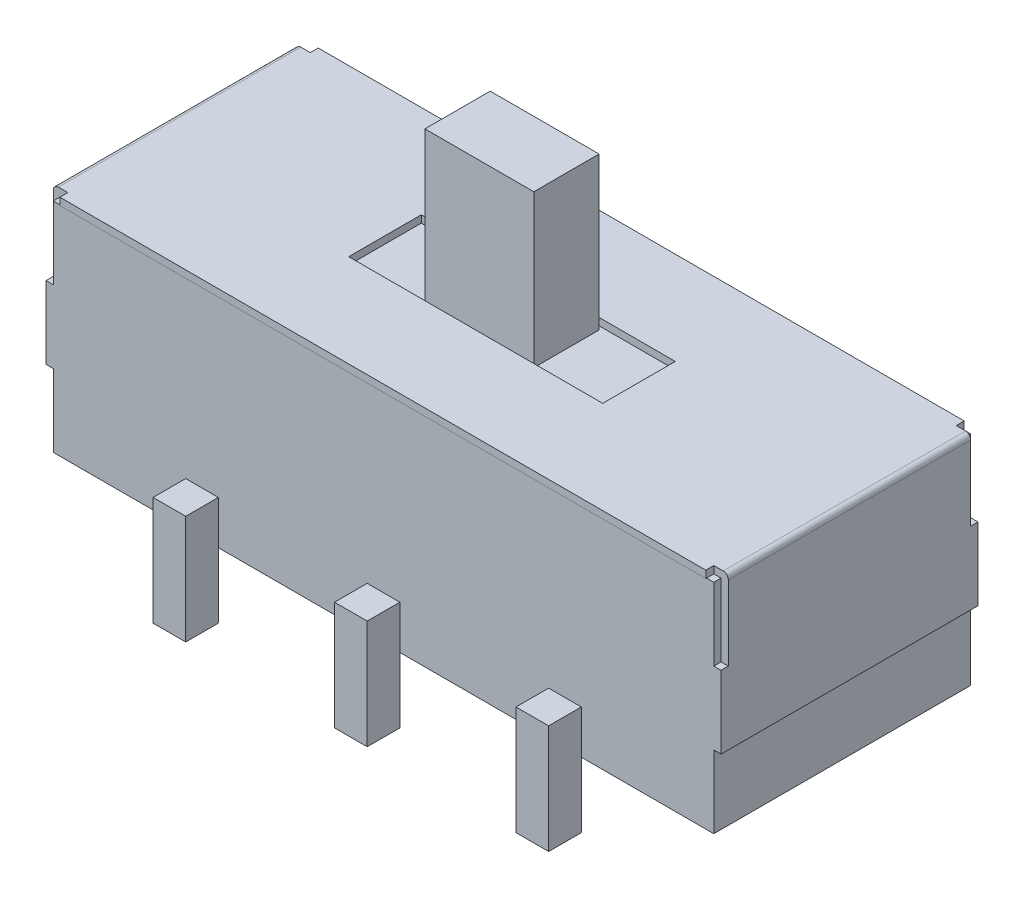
ISO-10303-21;
HEADER;
FILE_DESCRIPTION(('STEP AP214'),'2;1');
FILE_NAME('part.step','',(''),(''),'','','');
FILE_SCHEMA(('AUTOMOTIVE_DESIGN { 1 0 10303 214 1 1 1 1 }'));
ENDSEC;
DATA;
#1=APPLICATION_CONTEXT('core data for automotive mechanical design processes');
#2=APPLICATION_PROTOCOL_DEFINITION('international standard','automotive_design',2000,#1);
#3=PRODUCT_CONTEXT('',#1,'mechanical');
#4=PRODUCT('Part','Part','',(#3));
#5=PRODUCT_RELATED_PRODUCT_CATEGORY('part','',(#4));
#6=PRODUCT_DEFINITION_FORMATION('','',#4);
#7=PRODUCT_DEFINITION_CONTEXT('part definition',#1,'design');
#8=PRODUCT_DEFINITION('design','',#6,#7);
#9=PRODUCT_DEFINITION_SHAPE('','',#8);
#10=(LENGTH_UNIT() NAMED_UNIT(*) SI_UNIT(.MILLI.,.METRE.));
#11=(NAMED_UNIT(*) PLANE_ANGLE_UNIT() SI_UNIT($,.RADIAN.));
#12=(NAMED_UNIT(*) SI_UNIT($,.STERADIAN.) SOLID_ANGLE_UNIT());
#13=UNCERTAINTY_MEASURE_WITH_UNIT(LENGTH_MEASURE(1.E-05),#10,'distance_accuracy_value','');
#14=(GEOMETRIC_REPRESENTATION_CONTEXT(3) GLOBAL_UNCERTAINTY_ASSIGNED_CONTEXT((#13)) GLOBAL_UNIT_ASSIGNED_CONTEXT((#10,
#11,#12)) REPRESENTATION_CONTEXT('',''));
#15=CARTESIAN_POINT('',(0.,0.,0.));
#16=DIRECTION('',(0.,0.,1.));
#17=DIRECTION('',(1.,0.,0.));
#18=AXIS2_PLACEMENT_3D('',#15,#16,#17);
#19=CARTESIAN_POINT('',(0.,0.,-1.77));
#20=DIRECTION('',(0.,0.,-1.));
#21=DIRECTION('',(-1.,0.,0.));
#22=AXIS2_PLACEMENT_3D('',#19,#20,#21);
#23=PLANE('',#22);
#24=DIRECTION('',(1.,0.,0.));
#25=VECTOR('',#24,1.);
#26=CARTESIAN_POINT('',(-4.55,0.,-1.77));
#27=LINE('',#26,#25);
#28=CARTESIAN_POINT('',(-2.275,0.,-1.77));
#29=VERTEX_POINT('',#28);
#30=CARTESIAN_POINT('',(-0.225000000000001,0.,-1.77));
#31=VERTEX_POINT('',#30);
#32=EDGE_CURVE('E933',#29,#31,#27,.T.);
#33=ORIENTED_EDGE('',*,*,#32,.F.);
#34=DIRECTION('',(0.,-1.,0.));
#35=VECTOR('',#34,1.);
#36=CARTESIAN_POINT('',(-2.275,0.6,-1.77));
#37=LINE('',#36,#35);
#38=CARTESIAN_POINT('',(-2.275,0.6,-1.77));
#39=VERTEX_POINT('',#38);
#40=EDGE_CURVE('E625',#39,#29,#37,.T.);
#41=ORIENTED_EDGE('',*,*,#40,.F.);
#42=DIRECTION('',(1.,0.,0.));
#43=VECTOR('',#42,1.);
#44=CARTESIAN_POINT('',(-2.275,0.6,-1.77));
#45=LINE('',#44,#43);
#46=CARTESIAN_POINT('',(-2.725,0.6,-1.77));
#47=VERTEX_POINT('',#46);
#48=EDGE_CURVE('E620',#47,#39,#45,.T.);
#49=ORIENTED_EDGE('',*,*,#48,.F.);
#50=DIRECTION('',(0.,1.,0.));
#51=VECTOR('',#50,1.);
#52=CARTESIAN_POINT('',(-2.725,0.6,-1.77));
#53=LINE('',#52,#51);
#54=CARTESIAN_POINT('',(-2.725,0.,-1.77));
#55=VERTEX_POINT('',#54);
#56=EDGE_CURVE('E627',#55,#47,#53,.T.);
#57=ORIENTED_EDGE('',*,*,#56,.F.);
#58=CARTESIAN_POINT('',(-4.55,0.,-1.77));
#59=VERTEX_POINT('',#58);
#60=EDGE_CURVE('E928',#59,#55,#27,.T.);
#61=ORIENTED_EDGE('',*,*,#60,.F.);
#62=DIRECTION('',(0.,-1.,0.));
#63=VECTOR('',#62,1.);
#64=CARTESIAN_POINT('',(-4.55,0.,-1.77));
#65=LINE('',#64,#63);
#66=CARTESIAN_POINT('',(-4.55,1.,-1.77));
#67=VERTEX_POINT('',#66);
#68=EDGE_CURVE('E922',#67,#59,#65,.T.);
#69=ORIENTED_EDGE('',*,*,#68,.F.);
#70=DIRECTION('',(1.,0.,0.));
#71=VECTOR('',#70,1.);
#72=CARTESIAN_POINT('',(-4.65,1.,-1.77));
#73=LINE('',#72,#71);
#74=CARTESIAN_POINT('',(-4.65,1.,-1.77));
#75=VERTEX_POINT('',#74);
#76=EDGE_CURVE('E784',#75,#67,#73,.T.);
#77=ORIENTED_EDGE('',*,*,#76,.F.);
#78=DIRECTION('',(0.,-1.,0.));
#79=VECTOR('',#78,1.);
#80=CARTESIAN_POINT('',(-4.65,1.,-1.77));
#81=LINE('',#80,#79);
#82=CARTESIAN_POINT('',(-4.65,2.,-1.77));
#83=VERTEX_POINT('',#82);
#84=EDGE_CURVE('E749',#83,#75,#81,.T.);
#85=ORIENTED_EDGE('',*,*,#84,.F.);
#86=DIRECTION('',(1.,0.,0.));
#87=VECTOR('',#86,1.);
#88=CARTESIAN_POINT('',(-4.65,2.,-1.77));
#89=LINE('',#88,#87);
#90=CARTESIAN_POINT('',(-4.55,2.,-1.77));
#91=VERTEX_POINT('',#90);
#92=EDGE_CURVE('E762',#83,#91,#89,.T.);
#93=ORIENTED_EDGE('',*,*,#92,.T.);
#94=CARTESIAN_POINT('',(-4.55,3.,-1.77));
#95=VERTEX_POINT('',#94);
#96=EDGE_CURVE('E924',#95,#91,#65,.T.);
#97=ORIENTED_EDGE('',*,*,#96,.F.);
#98=DIRECTION('',(-1.,0.,0.));
#99=VECTOR('',#98,1.);
#100=CARTESIAN_POINT('',(-4.55,3.,-1.77));
#101=LINE('',#100,#99);
#102=CARTESIAN_POINT('',(-4.45,3.,-1.77));
#103=VERTEX_POINT('',#102);
#104=EDGE_CURVE('E938',#103,#95,#101,.T.);
#105=ORIENTED_EDGE('',*,*,#104,.F.);
#106=CARTESIAN_POINT('',(4.45,3.00000000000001,-1.77));
#107=VERTEX_POINT('',#106);
#108=EDGE_CURVE('E943',#107,#103,#101,.T.);
#109=ORIENTED_EDGE('',*,*,#108,.F.);
#110=CARTESIAN_POINT('',(4.55,3.00000000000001,-1.77));
#111=VERTEX_POINT('',#110);
#112=EDGE_CURVE('E939',#111,#107,#101,.T.);
#113=ORIENTED_EDGE('',*,*,#112,.F.);
#114=DIRECTION('',(0.,1.,0.));
#115=VECTOR('',#114,1.);
#116=CARTESIAN_POINT('',(4.55,0.,-1.77));
#117=LINE('',#116,#115);
#118=CARTESIAN_POINT('',(4.55,2.,-1.77));
#119=VERTEX_POINT('',#118);
#120=EDGE_CURVE('E931',#119,#111,#117,.T.);
#121=ORIENTED_EDGE('',*,*,#120,.F.);
#122=DIRECTION('',(-1.,0.,0.));
#123=VECTOR('',#122,1.);
#124=CARTESIAN_POINT('',(4.65,2.,-1.77));
#125=LINE('',#124,#123);
#126=CARTESIAN_POINT('',(4.65,2.,-1.77));
#127=VERTEX_POINT('',#126);
#128=EDGE_CURVE('E746',#127,#119,#125,.T.);
#129=ORIENTED_EDGE('',*,*,#128,.F.);
#130=DIRECTION('',(0.,-1.,0.));
#131=VECTOR('',#130,1.);
#132=CARTESIAN_POINT('',(4.65,1.,-1.77));
#133=LINE('',#132,#131);
#134=CARTESIAN_POINT('',(4.65,1.,-1.77));
#135=VERTEX_POINT('',#134);
#136=EDGE_CURVE('E708',#127,#135,#133,.T.);
#137=ORIENTED_EDGE('',*,*,#136,.T.);
#138=DIRECTION('',(-1.,0.,0.));
#139=VECTOR('',#138,1.);
#140=CARTESIAN_POINT('',(4.65,1.,-1.77));
#141=LINE('',#140,#139);
#142=CARTESIAN_POINT('',(4.55,1.,-1.77));
#143=VERTEX_POINT('',#142);
#144=EDGE_CURVE('E724',#135,#143,#141,.T.);
#145=ORIENTED_EDGE('',*,*,#144,.T.);
#146=CARTESIAN_POINT('',(4.55,0.,-1.77));
#147=VERTEX_POINT('',#146);
#148=EDGE_CURVE('E935',#147,#143,#117,.T.);
#149=ORIENTED_EDGE('',*,*,#148,.F.);
#150=CARTESIAN_POINT('',(2.725,0.,-1.77));
#151=VERTEX_POINT('',#150);
#152=EDGE_CURVE('E927',#151,#147,#27,.T.);
#153=ORIENTED_EDGE('',*,*,#152,.F.);
#154=DIRECTION('',(0.,-1.,0.));
#155=VECTOR('',#154,1.);
#156=CARTESIAN_POINT('',(2.725,0.599999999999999,-1.77));
#157=LINE('',#156,#155);
#158=CARTESIAN_POINT('',(2.725,0.599999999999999,-1.77));
#159=VERTEX_POINT('',#158);
#160=EDGE_CURVE('E640',#159,#151,#157,.T.);
#161=ORIENTED_EDGE('',*,*,#160,.F.);
#162=DIRECTION('',(1.,0.,0.));
#163=VECTOR('',#162,1.);
#164=CARTESIAN_POINT('',(2.275,0.6,-1.77));
#165=LINE('',#164,#163);
#166=CARTESIAN_POINT('',(2.275,0.6,-1.77));
#167=VERTEX_POINT('',#166);
#168=EDGE_CURVE('E648',#167,#159,#165,.T.);
#169=ORIENTED_EDGE('',*,*,#168,.F.);
#170=DIRECTION('',(0.,1.,0.));
#171=VECTOR('',#170,1.);
#172=CARTESIAN_POINT('',(2.275,0.6,-1.77));
#173=LINE('',#172,#171);
#174=CARTESIAN_POINT('',(2.275,0.,-1.77));
#175=VERTEX_POINT('',#174);
#176=EDGE_CURVE('E636',#175,#167,#173,.T.);
#177=ORIENTED_EDGE('',*,*,#176,.F.);
#178=CARTESIAN_POINT('',(0.224999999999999,0.,-1.77));
#179=VERTEX_POINT('',#178);
#180=EDGE_CURVE('E2244',#179,#175,#27,.T.);
#181=ORIENTED_EDGE('',*,*,#180,.F.);
#182=DIRECTION('',(0.,-1.,0.));
#183=VECTOR('',#182,1.);
#184=CARTESIAN_POINT('',(0.224999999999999,0.6,-1.77));
#185=LINE('',#184,#183);
#186=CARTESIAN_POINT('',(0.224999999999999,0.6,-1.77));
#187=VERTEX_POINT('',#186);
#188=EDGE_CURVE('E661',#187,#179,#185,.T.);
#189=ORIENTED_EDGE('',*,*,#188,.F.);
#190=DIRECTION('',(1.,0.,0.));
#191=VECTOR('',#190,1.);
#192=CARTESIAN_POINT('',(-0.225000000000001,0.6,-1.77));
#193=LINE('',#192,#191);
#194=CARTESIAN_POINT('',(-0.225000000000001,0.6,-1.77));
#195=VERTEX_POINT('',#194);
#196=EDGE_CURVE('E668',#195,#187,#193,.T.);
#197=ORIENTED_EDGE('',*,*,#196,.F.);
#198=DIRECTION('',(0.,-1.,0.));
#199=VECTOR('',#198,1.);
#200=CARTESIAN_POINT('',(-0.225000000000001,0.,-1.77));
#201=LINE('',#200,#199);
#202=EDGE_CURVE('E974',#195,#31,#201,.T.);
#203=ORIENTED_EDGE('',*,*,#202,.T.);
#204=EDGE_LOOP('',(#33,#41,#49,#57,#61,#69,#77,#85,#93,#97,#105,#109,#113,#121,#129,#137,#145,
#149,#153,#161,#169,#177,#181,#189,#197,#203));
#205=FACE_BOUND('',#204,.T.);
#206=ADVANCED_FACE('F34',(#205),#23,.T.);
#207=CARTESIAN_POINT('',(-4.55,3.,-1.77));
#208=DIRECTION('',(0.,1.,0.));
#209=DIRECTION('',(-1.,0.,0.));
#210=AXIS2_PLACEMENT_3D('',#207,#208,#209);
#211=PLANE('',#210);
#212=DIRECTION('',(-1.,0.,0.));
#213=VECTOR('',#212,1.);
#214=CARTESIAN_POINT('',(-1.75,3.,-0.5));
#215=LINE('',#214,#213);
#216=CARTESIAN_POINT('',(1.75,3.,-0.5));
#217=VERTEX_POINT('',#216);
#218=CARTESIAN_POINT('',(-1.75,3.,-0.5));
#219=VERTEX_POINT('',#218);
#220=EDGE_CURVE('E790',#217,#219,#215,.T.);
#221=ORIENTED_EDGE('',*,*,#220,.T.);
#222=DIRECTION('',(0.,0.,1.));
#223=VECTOR('',#222,1.);
#224=CARTESIAN_POINT('',(-1.75,3.,-0.5));
#225=LINE('',#224,#223);
#226=CARTESIAN_POINT('',(-1.75,3.,0.5));
#227=VERTEX_POINT('',#226);
#228=EDGE_CURVE('E786',#219,#227,#225,.T.);
#229=ORIENTED_EDGE('',*,*,#228,.T.);
#230=DIRECTION('',(1.,0.,0.));
#231=VECTOR('',#230,1.);
#232=CARTESIAN_POINT('',(-1.75,3.,0.5));
#233=LINE('',#232,#231);
#234=CARTESIAN_POINT('',(1.75,3.,0.5));
#235=VERTEX_POINT('',#234);
#236=EDGE_CURVE('E800',#227,#235,#233,.T.);
#237=ORIENTED_EDGE('',*,*,#236,.T.);
#238=DIRECTION('',(0.,0.,-1.));
#239=VECTOR('',#238,1.);
#240=CARTESIAN_POINT('',(1.75,3.,-0.5));
#241=LINE('',#240,#239);
#242=EDGE_CURVE('E803',#235,#217,#241,.T.);
#243=ORIENTED_EDGE('',*,*,#242,.T.);
#244=EDGE_LOOP('',(#221,#229,#237,#243));
#245=FACE_BOUND('',#244,.T.);
#246=DIRECTION('',(1.,0.,0.));
#247=VECTOR('',#246,1.);
#248=CARTESIAN_POINT('',(-0.750000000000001,3.,0.45));
#249=LINE('',#248,#247);
#250=CARTESIAN_POINT('',(-0.750000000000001,3.,0.45));
#251=VERTEX_POINT('',#250);
#252=CARTESIAN_POINT('',(0.749999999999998,3.,0.45));
#253=VERTEX_POINT('',#252);
#254=EDGE_CURVE('E692',#251,#253,#249,.T.);
#255=ORIENTED_EDGE('',*,*,#254,.F.);
#256=DIRECTION('',(0.,0.,1.));
#257=VECTOR('',#256,1.);
#258=CARTESIAN_POINT('',(-0.750000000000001,3.,-0.45));
#259=LINE('',#258,#257);
#260=CARTESIAN_POINT('',(-0.750000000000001,3.,-0.45));
#261=VERTEX_POINT('',#260);
#262=EDGE_CURVE('E678',#261,#251,#259,.T.);
#263=ORIENTED_EDGE('',*,*,#262,.F.);
#264=DIRECTION('',(-1.,0.,0.));
#265=VECTOR('',#264,1.);
#266=CARTESIAN_POINT('',(-0.750000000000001,3.,-0.45));
#267=LINE('',#266,#265);
#268=CARTESIAN_POINT('',(0.749999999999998,3.,-0.45));
#269=VERTEX_POINT('',#268);
#270=EDGE_CURVE('E683',#269,#261,#267,.T.);
#271=ORIENTED_EDGE('',*,*,#270,.F.);
#272=DIRECTION('',(0.,0.,-1.));
#273=VECTOR('',#272,1.);
#274=CARTESIAN_POINT('',(0.749999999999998,3.,-0.45));
#275=LINE('',#274,#273);
#276=EDGE_CURVE('E694',#253,#269,#275,.T.);
#277=ORIENTED_EDGE('',*,*,#276,.F.);
#278=EDGE_LOOP('',(#255,#263,#271,#277));
#279=FACE_BOUND('',#278,.T.);
#280=ADVANCED_FACE('F1183',(#245,#279),#211,.T.);
#281=CARTESIAN_POINT('',(4.55,0.,-1.77));
#282=DIRECTION('',(1.,0.,0.));
#283=DIRECTION('',(0.,1.,0.));
#284=AXIS2_PLACEMENT_3D('',#281,#282,#283);
#285=PLANE('',#284);
#286=DIRECTION('',(0.,0.,-1.));
#287=VECTOR('',#286,1.);
#288=CARTESIAN_POINT('',(4.55,2.,-1.77));
#289=LINE('',#288,#287);
#290=CARTESIAN_POINT('',(4.55,2.,-1.67));
#291=VERTEX_POINT('',#290);
#292=EDGE_CURVE('E707',#291,#119,#289,.T.);
#293=ORIENTED_EDGE('',*,*,#292,.T.);
#294=ORIENTED_EDGE('',*,*,#120,.T.);
#295=DIRECTION('',(0.,0.,1.));
#296=VECTOR('',#295,1.);
#297=CARTESIAN_POINT('',(4.55,3.00000000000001,-1.77));
#298=LINE('',#297,#296);
#299=CARTESIAN_POINT('',(4.55,3.00000000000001,-1.67));
#300=VERTEX_POINT('',#299);
#301=EDGE_CURVE('E947',#111,#300,#298,.T.);
#302=ORIENTED_EDGE('',*,*,#301,.T.);
#303=DIRECTION('',(0.,-1.,0.));
#304=VECTOR('',#303,1.);
#305=CARTESIAN_POINT('',(4.55,3.,-1.67));
#306=LINE('',#305,#304);
#307=EDGE_CURVE('E727',#300,#291,#306,.T.);
#308=ORIENTED_EDGE('',*,*,#307,.T.);
#309=EDGE_LOOP('',(#293,#294,#302,#308));
#310=FACE_BOUND('',#309,.T.);
#311=ADVANCED_FACE('F1189',(#310),#285,.T.);
#312=DIRECTION('',(0.,1.,0.));
#313=VECTOR('',#312,1.);
#314=CARTESIAN_POINT('',(4.55,3.,1.67));
#315=LINE('',#314,#313);
#316=CARTESIAN_POINT('',(4.55,2.,1.67));
#317=VERTEX_POINT('',#316);
#318=CARTESIAN_POINT('',(4.55,3.,1.67));
#319=VERTEX_POINT('',#318);
#320=EDGE_CURVE('E730',#317,#319,#315,.T.);
#321=ORIENTED_EDGE('',*,*,#320,.T.);
#322=CARTESIAN_POINT('',(4.55,3.00000000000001,1.77));
#323=VERTEX_POINT('',#322);
#324=EDGE_CURVE('E950',#319,#323,#298,.T.);
#325=ORIENTED_EDGE('',*,*,#324,.T.);
#326=DIRECTION('',(0.,1.,0.));
#327=VECTOR('',#326,1.);
#328=CARTESIAN_POINT('',(4.55,0.,1.77));
#329=LINE('',#328,#327);
#330=CARTESIAN_POINT('',(4.55,2.,1.77));
#331=VERTEX_POINT('',#330);
#332=EDGE_CURVE('E911',#331,#323,#329,.T.);
#333=ORIENTED_EDGE('',*,*,#332,.F.);
#334=DIRECTION('',(0.,0.,-1.));
#335=VECTOR('',#334,1.);
#336=CARTESIAN_POINT('',(4.55,2.,1.67));
#337=LINE('',#336,#335);
#338=EDGE_CURVE('E732',#331,#317,#337,.T.);
#339=ORIENTED_EDGE('',*,*,#338,.T.);
#340=EDGE_LOOP('',(#321,#325,#333,#339));
#341=FACE_BOUND('',#340,.T.);
#342=ADVANCED_FACE('F1207',(#341),#285,.T.);
#343=CARTESIAN_POINT('',(-4.55,0.,-1.77));
#344=DIRECTION('',(-1.,0.,0.));
#345=DIRECTION('',(0.,-1.,0.));
#346=AXIS2_PLACEMENT_3D('',#343,#344,#345);
#347=PLANE('',#346);
#348=DIRECTION('',(0.,-1.,0.));
#349=VECTOR('',#348,1.);
#350=CARTESIAN_POINT('',(-4.55,0.,1.77));
#351=LINE('',#350,#349);
#352=CARTESIAN_POINT('',(-4.55,1.,1.77));
#353=VERTEX_POINT('',#352);
#354=CARTESIAN_POINT('',(-4.55,0.,1.77));
#355=VERTEX_POINT('',#354);
#356=EDGE_CURVE('E903',#353,#355,#351,.T.);
#357=ORIENTED_EDGE('',*,*,#356,.F.);
#358=DIRECTION('',(0.,0.,1.));
#359=VECTOR('',#358,1.);
#360=CARTESIAN_POINT('',(-4.55,1.,-1.77));
#361=LINE('',#360,#359);
#362=EDGE_CURVE('E748',#67,#353,#361,.T.);
#363=ORIENTED_EDGE('',*,*,#362,.F.);
#364=ORIENTED_EDGE('',*,*,#68,.T.);
#365=DIRECTION('',(0.,0.,1.));
#366=VECTOR('',#365,1.);
#367=CARTESIAN_POINT('',(-4.55,0.,-1.77));
#368=LINE('',#367,#366);
#369=EDGE_CURVE('E942',#59,#355,#368,.T.);
#370=ORIENTED_EDGE('',*,*,#369,.T.);
#371=EDGE_LOOP('',(#357,#363,#364,#370));
#372=FACE_BOUND('',#371,.T.);
#373=ADVANCED_FACE('F1211',(#372),#347,.T.);
#374=DIRECTION('',(0.,1.,0.));
#375=VECTOR('',#374,1.);
#376=CARTESIAN_POINT('',(-4.55,3.,1.67));
#377=LINE('',#376,#375);
#378=CARTESIAN_POINT('',(-4.55,2.,1.67));
#379=VERTEX_POINT('',#378);
#380=CARTESIAN_POINT('',(-4.55,3.,1.67));
#381=VERTEX_POINT('',#380);
#382=EDGE_CURVE('E766',#379,#381,#377,.T.);
#383=ORIENTED_EDGE('',*,*,#382,.F.);
#384=DIRECTION('',(0.,0.,-1.));
#385=VECTOR('',#384,1.);
#386=CARTESIAN_POINT('',(-4.55,2.,1.67));
#387=LINE('',#386,#385);
#388=CARTESIAN_POINT('',(-4.55,2.,1.77));
#389=VERTEX_POINT('',#388);
#390=EDGE_CURVE('E764',#389,#379,#387,.T.);
#391=ORIENTED_EDGE('',*,*,#390,.F.);
#392=CARTESIAN_POINT('',(-4.55,3.,1.77));
#393=VERTEX_POINT('',#392);
#394=EDGE_CURVE('E904',#393,#389,#351,.T.);
#395=ORIENTED_EDGE('',*,*,#394,.F.);
#396=DIRECTION('',(0.,0.,1.));
#397=VECTOR('',#396,1.);
#398=CARTESIAN_POINT('',(-4.55,3.,-1.77));
#399=LINE('',#398,#397);
#400=EDGE_CURVE('E946',#381,#393,#399,.T.);
#401=ORIENTED_EDGE('',*,*,#400,.F.);
#402=EDGE_LOOP('',(#383,#391,#395,#401));
#403=FACE_BOUND('',#402,.T.);
#404=ADVANCED_FACE('F1214',(#403),#347,.T.);
#405=DIRECTION('',(0.,0.,-1.));
#406=VECTOR('',#405,1.);
#407=CARTESIAN_POINT('',(-4.55,2.,-1.77));
#408=LINE('',#407,#406);
#409=CARTESIAN_POINT('',(-4.55,2.,-1.67));
#410=VERTEX_POINT('',#409);
#411=EDGE_CURVE('E753',#410,#91,#408,.T.);
#412=ORIENTED_EDGE('',*,*,#411,.F.);
#413=DIRECTION('',(0.,-1.,0.));
#414=VECTOR('',#413,1.);
#415=CARTESIAN_POINT('',(-4.55,3.,-1.67));
#416=LINE('',#415,#414);
#417=CARTESIAN_POINT('',(-4.55,3.,-1.67));
#418=VERTEX_POINT('',#417);
#419=EDGE_CURVE('E768',#418,#410,#416,.T.);
#420=ORIENTED_EDGE('',*,*,#419,.F.);
#421=EDGE_CURVE('E848',#95,#418,#399,.T.);
#422=ORIENTED_EDGE('',*,*,#421,.F.);
#423=ORIENTED_EDGE('',*,*,#96,.T.);
#424=EDGE_LOOP('',(#412,#420,#422,#423));
#425=FACE_BOUND('',#424,.T.);
#426=ADVANCED_FACE('F1216',(#425),#347,.T.);
#427=DIRECTION('',(-1.,0.,0.));
#428=VECTOR('',#427,1.);
#429=CARTESIAN_POINT('',(-4.65,3.,-1.67));
#430=LINE('',#429,#428);
#431=CARTESIAN_POINT('',(-4.45,3.,-1.67));
#432=VERTEX_POINT('',#431);
#433=EDGE_CURVE('E816',#432,#418,#430,.T.);
#434=ORIENTED_EDGE('',*,*,#433,.F.);
#435=DIRECTION('',(0.,0.,1.));
#436=VECTOR('',#435,1.);
#437=CARTESIAN_POINT('',(-4.45,3.,-1.67));
#438=LINE('',#437,#436);
#439=EDGE_CURVE('E864',#103,#432,#438,.T.);
#440=ORIENTED_EDGE('',*,*,#439,.F.);
#441=ORIENTED_EDGE('',*,*,#104,.T.);
#442=ORIENTED_EDGE('',*,*,#421,.T.);
#443=EDGE_LOOP('',(#434,#440,#441,#442));
#444=FACE_BOUND('',#443,.T.);
#445=ADVANCED_FACE('F1192',(#444),#211,.T.);
#446=DIRECTION('',(0.,0.,-1.));
#447=VECTOR('',#446,1.);
#448=CARTESIAN_POINT('',(4.45,3.00000000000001,-1.67));
#449=LINE('',#448,#447);
#450=CARTESIAN_POINT('',(4.45,3.00000000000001,-1.67));
#451=VERTEX_POINT('',#450);
#452=EDGE_CURVE('E865',#451,#107,#449,.T.);
#453=ORIENTED_EDGE('',*,*,#452,.F.);
#454=DIRECTION('',(-1.,0.,0.));
#455=VECTOR('',#454,1.);
#456=CARTESIAN_POINT('',(4.65,3.00000000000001,-1.67));
#457=LINE('',#456,#455);
#458=EDGE_CURVE('E861',#300,#451,#457,.T.);
#459=ORIENTED_EDGE('',*,*,#458,.F.);
#460=ORIENTED_EDGE('',*,*,#301,.F.);
#461=ORIENTED_EDGE('',*,*,#112,.T.);
#462=EDGE_LOOP('',(#453,#459,#460,#461));
#463=FACE_BOUND('',#462,.T.);
#464=ADVANCED_FACE('F1815',(#463),#211,.T.);
#465=DIRECTION('',(1.,0.,0.));
#466=VECTOR('',#465,1.);
#467=CARTESIAN_POINT('',(4.65,3.00000000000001,1.67));
#468=LINE('',#467,#466);
#469=CARTESIAN_POINT('',(4.45,3.00000000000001,1.67));
#470=VERTEX_POINT('',#469);
#471=EDGE_CURVE('E857',#470,#319,#468,.T.);
#472=ORIENTED_EDGE('',*,*,#471,.F.);
#473=DIRECTION('',(0.,0.,-1.));
#474=VECTOR('',#473,1.);
#475=CARTESIAN_POINT('',(4.45,3.00000000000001,1.67));
#476=LINE('',#475,#474);
#477=CARTESIAN_POINT('',(4.45,3.00000000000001,1.77));
#478=VERTEX_POINT('',#477);
#479=EDGE_CURVE('E847',#478,#470,#476,.T.);
#480=ORIENTED_EDGE('',*,*,#479,.F.);
#481=DIRECTION('',(-1.,0.,0.));
#482=VECTOR('',#481,1.);
#483=CARTESIAN_POINT('',(-4.55,3.,1.77));
#484=LINE('',#483,#482);
#485=EDGE_CURVE('E919',#323,#478,#484,.T.);
#486=ORIENTED_EDGE('',*,*,#485,.F.);
#487=ORIENTED_EDGE('',*,*,#324,.F.);
#488=EDGE_LOOP('',(#472,#480,#486,#487));
#489=FACE_BOUND('',#488,.T.);
#490=ADVANCED_FACE('F1201',(#489),#211,.T.);
#491=DIRECTION('',(0.,0.,1.));
#492=VECTOR('',#491,1.);
#493=CARTESIAN_POINT('',(-4.45,3.,1.67));
#494=LINE('',#493,#492);
#495=CARTESIAN_POINT('',(-4.45,3.,1.67));
#496=VERTEX_POINT('',#495);
#497=CARTESIAN_POINT('',(-4.45,3.,1.77));
#498=VERTEX_POINT('',#497);
#499=EDGE_CURVE('E849',#496,#498,#494,.T.);
#500=ORIENTED_EDGE('',*,*,#499,.F.);
#501=DIRECTION('',(1.,0.,0.));
#502=VECTOR('',#501,1.);
#503=CARTESIAN_POINT('',(-4.65,3.,1.67));
#504=LINE('',#503,#502);
#505=EDGE_CURVE('E844',#381,#496,#504,.T.);
#506=ORIENTED_EDGE('',*,*,#505,.F.);
#507=ORIENTED_EDGE('',*,*,#400,.T.);
#508=EDGE_CURVE('E918',#498,#393,#484,.T.);
#509=ORIENTED_EDGE('',*,*,#508,.F.);
#510=EDGE_LOOP('',(#500,#506,#507,#509));
#511=FACE_BOUND('',#510,.T.);
#512=ADVANCED_FACE('F1193',(#511),#211,.T.);
#513=DIRECTION('',(0.,0.,1.));
#514=VECTOR('',#513,1.);
#515=CARTESIAN_POINT('',(4.55,1.,-1.77));
#516=LINE('',#515,#514);
#517=CARTESIAN_POINT('',(4.55,1.,1.77));
#518=VERTEX_POINT('',#517);
#519=EDGE_CURVE('E712',#143,#518,#516,.T.);
#520=ORIENTED_EDGE('',*,*,#519,.T.);
#521=CARTESIAN_POINT('',(4.55,0.,1.77));
#522=VERTEX_POINT('',#521);
#523=EDGE_CURVE('E915',#522,#518,#329,.T.);
#524=ORIENTED_EDGE('',*,*,#523,.F.);
#525=DIRECTION('',(0.,0.,1.));
#526=VECTOR('',#525,1.);
#527=CARTESIAN_POINT('',(4.55,0.,-1.77));
#528=LINE('',#527,#526);
#529=EDGE_CURVE('E951',#147,#522,#528,.T.);
#530=ORIENTED_EDGE('',*,*,#529,.F.);
#531=ORIENTED_EDGE('',*,*,#148,.T.);
#532=EDGE_LOOP('',(#520,#524,#530,#531));
#533=FACE_BOUND('',#532,.T.);
#534=ADVANCED_FACE('F1200',(#533),#285,.T.);
#535=CARTESIAN_POINT('',(-4.55,0.,-1.77));
#536=DIRECTION('',(0.,-1.,0.));
#537=DIRECTION('',(1.,0.,0.));
#538=AXIS2_PLACEMENT_3D('',#535,#536,#537);
#539=PLANE('',#538);
#540=ORIENTED_EDGE('',*,*,#529,.T.);
#541=DIRECTION('',(1.,0.,0.));
#542=VECTOR('',#541,1.);
#543=CARTESIAN_POINT('',(-4.55,0.,1.77));
#544=LINE('',#543,#542);
#545=CARTESIAN_POINT('',(2.725,0.,1.77));
#546=VERTEX_POINT('',#545);
#547=EDGE_CURVE('E907',#546,#522,#544,.T.);
#548=ORIENTED_EDGE('',*,*,#547,.F.);
#549=CARTESIAN_POINT('',(2.275,0.,1.77));
#550=VERTEX_POINT('',#549);
#551=EDGE_CURVE('E2292',#550,#546,#544,.T.);
#552=ORIENTED_EDGE('',*,*,#551,.F.);
#553=CARTESIAN_POINT('',(0.224999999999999,0.,1.77));
#554=VERTEX_POINT('',#553);
#555=EDGE_CURVE('E2294',#554,#550,#544,.T.);
#556=ORIENTED_EDGE('',*,*,#555,.F.);
#557=CARTESIAN_POINT('',(-0.225000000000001,0.,1.77));
#558=VERTEX_POINT('',#557);
#559=EDGE_CURVE('E914',#558,#554,#544,.T.);
#560=ORIENTED_EDGE('',*,*,#559,.F.);
#561=CARTESIAN_POINT('',(-2.275,0.,1.77));
#562=VERTEX_POINT('',#561);
#563=EDGE_CURVE('E913',#562,#558,#544,.T.);
#564=ORIENTED_EDGE('',*,*,#563,.F.);
#565=CARTESIAN_POINT('',(-2.725,0.,1.77));
#566=VERTEX_POINT('',#565);
#567=EDGE_CURVE('E912',#566,#562,#544,.T.);
#568=ORIENTED_EDGE('',*,*,#567,.F.);
#569=EDGE_CURVE('E908',#355,#566,#544,.T.);
#570=ORIENTED_EDGE('',*,*,#569,.F.);
#571=ORIENTED_EDGE('',*,*,#369,.F.);
#572=ORIENTED_EDGE('',*,*,#60,.T.);
#573=EDGE_CURVE('E932',#55,#29,#27,.T.);
#574=ORIENTED_EDGE('',*,*,#573,.T.);
#575=ORIENTED_EDGE('',*,*,#32,.T.);
#576=EDGE_CURVE('E934',#31,#179,#27,.T.);
#577=ORIENTED_EDGE('',*,*,#576,.T.);
#578=ORIENTED_EDGE('',*,*,#180,.T.);
#579=EDGE_CURVE('E2243',#175,#151,#27,.T.);
#580=ORIENTED_EDGE('',*,*,#579,.T.);
#581=ORIENTED_EDGE('',*,*,#152,.T.);
#582=EDGE_LOOP('',(#540,#548,#552,#556,#560,#564,#568,#570,#571,#572,#574,#575,#577,#578,#580,#581));
#583=FACE_BOUND('',#582,.T.);
#584=ADVANCED_FACE('F1205',(#583),#539,.T.);
#585=CARTESIAN_POINT('',(0.,0.,1.77));
#586=DIRECTION('',(0.,0.,-1.));
#587=DIRECTION('',(-1.,0.,0.));
#588=AXIS2_PLACEMENT_3D('',#585,#586,#587);
#589=PLANE('',#588);
#590=DIRECTION('',(1.,0.,0.));
#591=VECTOR('',#590,1.);
#592=CARTESIAN_POINT('',(-2.275,0.6,1.77));
#593=LINE('',#592,#591);
#594=CARTESIAN_POINT('',(-2.725,0.6,1.77));
#595=VERTEX_POINT('',#594);
#596=CARTESIAN_POINT('',(-2.275,0.6,1.77));
#597=VERTEX_POINT('',#596);
#598=EDGE_CURVE('E567',#595,#597,#593,.T.);
#599=ORIENTED_EDGE('',*,*,#598,.T.);
#600=DIRECTION('',(0.,-1.,0.));
#601=VECTOR('',#600,1.);
#602=CARTESIAN_POINT('',(-2.275,0.6,1.77));
#603=LINE('',#602,#601);
#604=EDGE_CURVE('E547',#597,#562,#603,.T.);
#605=ORIENTED_EDGE('',*,*,#604,.T.);
#606=ORIENTED_EDGE('',*,*,#563,.T.);
#607=DIRECTION('',(0.,1.,0.));
#608=VECTOR('',#607,1.);
#609=CARTESIAN_POINT('',(-0.225000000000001,0.,1.77));
#610=LINE('',#609,#608);
#611=CARTESIAN_POINT('',(-0.225000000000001,0.6,1.77));
#612=VERTEX_POINT('',#611);
#613=EDGE_CURVE('E977',#558,#612,#610,.T.);
#614=ORIENTED_EDGE('',*,*,#613,.T.);
#615=DIRECTION('',(1.,0.,0.));
#616=VECTOR('',#615,1.);
#617=CARTESIAN_POINT('',(-0.225000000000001,0.6,1.77));
#618=LINE('',#617,#616);
#619=CARTESIAN_POINT('',(0.224999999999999,0.6,1.77));
#620=VERTEX_POINT('',#619);
#621=EDGE_CURVE('E597',#612,#620,#618,.T.);
#622=ORIENTED_EDGE('',*,*,#621,.T.);
#623=DIRECTION('',(0.,-1.,0.));
#624=VECTOR('',#623,1.);
#625=CARTESIAN_POINT('',(0.224999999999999,0.6,1.77));
#626=LINE('',#625,#624);
#627=EDGE_CURVE('E606',#620,#554,#626,.T.);
#628=ORIENTED_EDGE('',*,*,#627,.T.);
#629=ORIENTED_EDGE('',*,*,#555,.T.);
#630=DIRECTION('',(0.,1.,0.));
#631=VECTOR('',#630,1.);
#632=CARTESIAN_POINT('',(2.275,0.,1.77));
#633=LINE('',#632,#631);
#634=CARTESIAN_POINT('',(2.275,0.6,1.77));
#635=VERTEX_POINT('',#634);
#636=EDGE_CURVE('E980',#550,#635,#633,.T.);
#637=ORIENTED_EDGE('',*,*,#636,.T.);
#638=DIRECTION('',(1.,0.,0.));
#639=VECTOR('',#638,1.);
#640=CARTESIAN_POINT('',(2.275,0.6,1.77));
#641=LINE('',#640,#639);
#642=CARTESIAN_POINT('',(2.725,0.599999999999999,1.77));
#643=VERTEX_POINT('',#642);
#644=EDGE_CURVE('E575',#635,#643,#641,.T.);
#645=ORIENTED_EDGE('',*,*,#644,.T.);
#646=DIRECTION('',(0.,-1.,0.));
#647=VECTOR('',#646,1.);
#648=CARTESIAN_POINT('',(2.725,0.599999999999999,1.77));
#649=LINE('',#648,#647);
#650=EDGE_CURVE('E584',#643,#546,#649,.T.);
#651=ORIENTED_EDGE('',*,*,#650,.T.);
#652=ORIENTED_EDGE('',*,*,#547,.T.);
#653=ORIENTED_EDGE('',*,*,#523,.T.);
#654=DIRECTION('',(-1.,0.,0.));
#655=VECTOR('',#654,1.);
#656=CARTESIAN_POINT('',(4.65,1.,1.77));
#657=LINE('',#656,#655);
#658=CARTESIAN_POINT('',(4.65,1.,1.77));
#659=VERTEX_POINT('',#658);
#660=EDGE_CURVE('E738',#659,#518,#657,.T.);
#661=ORIENTED_EDGE('',*,*,#660,.F.);
#662=DIRECTION('',(0.,1.,0.));
#663=VECTOR('',#662,1.);
#664=CARTESIAN_POINT('',(4.65,1.,1.77));
#665=LINE('',#664,#663);
#666=CARTESIAN_POINT('',(4.65,2.,1.77));
#667=VERTEX_POINT('',#666);
#668=EDGE_CURVE('E718',#659,#667,#665,.T.);
#669=ORIENTED_EDGE('',*,*,#668,.T.);
#670=DIRECTION('',(-1.,0.,0.));
#671=VECTOR('',#670,1.);
#672=CARTESIAN_POINT('',(4.65,2.,1.77));
#673=LINE('',#672,#671);
#674=EDGE_CURVE('E740',#667,#331,#673,.T.);
#675=ORIENTED_EDGE('',*,*,#674,.T.);
#676=ORIENTED_EDGE('',*,*,#332,.T.);
#677=ORIENTED_EDGE('',*,*,#485,.T.);
#678=EDGE_CURVE('E923',#478,#498,#484,.T.);
#679=ORIENTED_EDGE('',*,*,#678,.T.);
#680=ORIENTED_EDGE('',*,*,#508,.T.);
#681=ORIENTED_EDGE('',*,*,#394,.T.);
#682=DIRECTION('',(1.,0.,0.));
#683=VECTOR('',#682,1.);
#684=CARTESIAN_POINT('',(-4.65,2.,1.77));
#685=LINE('',#684,#683);
#686=CARTESIAN_POINT('',(-4.65,2.,1.77));
#687=VERTEX_POINT('',#686);
#688=EDGE_CURVE('E779',#687,#389,#685,.T.);
#689=ORIENTED_EDGE('',*,*,#688,.F.);
#690=DIRECTION('',(0.,1.,0.));
#691=VECTOR('',#690,1.);
#692=CARTESIAN_POINT('',(-4.65,1.,1.77));
#693=LINE('',#692,#691);
#694=CARTESIAN_POINT('',(-4.65,1.,1.77));
#695=VERTEX_POINT('',#694);
#696=EDGE_CURVE('E755',#695,#687,#693,.T.);
#697=ORIENTED_EDGE('',*,*,#696,.F.);
#698=DIRECTION('',(1.,0.,0.));
#699=VECTOR('',#698,1.);
#700=CARTESIAN_POINT('',(-4.65,1.,1.77));
#701=LINE('',#700,#699);
#702=EDGE_CURVE('E781',#695,#353,#701,.T.);
#703=ORIENTED_EDGE('',*,*,#702,.T.);
#704=ORIENTED_EDGE('',*,*,#356,.T.);
#705=ORIENTED_EDGE('',*,*,#569,.T.);
#706=DIRECTION('',(0.,1.,0.));
#707=VECTOR('',#706,1.);
#708=CARTESIAN_POINT('',(-2.725,0.,1.77));
#709=LINE('',#708,#707);
#710=EDGE_CURVE('E983',#566,#595,#709,.T.);
#711=ORIENTED_EDGE('',*,*,#710,.T.);
#712=EDGE_LOOP('',(#599,#605,#606,#614,#622,#628,#629,#637,#645,#651,#652,#653,#661,#669,#675,
#676,#677,#679,#680,#681,#689,#697,#703,#704,#705,#711));
#713=FACE_BOUND('',#712,.T.);
#714=ADVANCED_FACE('F1196',(#713),#589,.F.);
#715=CARTESIAN_POINT('',(0.,3.,0.));
#716=DIRECTION('',(0.,1.,0.));
#717=DIRECTION('',(0.,0.,1.));
#718=AXIS2_PLACEMENT_3D('',#715,#716,#717);
#719=PLANE('',#718);
#720=ORIENTED_EDGE('',*,*,#678,.F.);
#721=CARTESIAN_POINT('',(4.45,3.00000000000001,1.78));
#722=VERTEX_POINT('',#721);
#723=EDGE_CURVE('E854',#722,#478,#476,.T.);
#724=ORIENTED_EDGE('',*,*,#723,.F.);
#725=DIRECTION('',(1.,0.,0.));
#726=VECTOR('',#725,1.);
#727=CARTESIAN_POINT('',(-4.45,3.,1.78));
#728=LINE('',#727,#726);
#729=CARTESIAN_POINT('',(-4.45,3.,1.78));
#730=VERTEX_POINT('',#729);
#731=EDGE_CURVE('E852',#730,#722,#728,.T.);
#732=ORIENTED_EDGE('',*,*,#731,.F.);
#733=EDGE_CURVE('E843',#498,#730,#494,.T.);
#734=ORIENTED_EDGE('',*,*,#733,.F.);
#735=EDGE_LOOP('',(#720,#724,#732,#734));
#736=FACE_BOUND('',#735,.T.);
#737=ADVANCED_FACE('F1551',(#736),#719,.F.);
#738=CARTESIAN_POINT('',(4.45,3.00000000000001,-1.78));
#739=VERTEX_POINT('',#738);
#740=EDGE_CURVE('E860',#107,#739,#449,.T.);
#741=ORIENTED_EDGE('',*,*,#740,.F.);
#742=ORIENTED_EDGE('',*,*,#108,.T.);
#743=CARTESIAN_POINT('',(-4.45,3.,-1.78));
#744=VERTEX_POINT('',#743);
#745=EDGE_CURVE('E821',#744,#103,#438,.T.);
#746=ORIENTED_EDGE('',*,*,#745,.F.);
#747=DIRECTION('',(-1.,0.,0.));
#748=VECTOR('',#747,1.);
#749=CARTESIAN_POINT('',(-4.45,3.,-1.78));
#750=LINE('',#749,#748);
#751=EDGE_CURVE('E868',#739,#744,#750,.T.);
#752=ORIENTED_EDGE('',*,*,#751,.F.);
#753=EDGE_LOOP('',(#741,#742,#746,#752));
#754=FACE_BOUND('',#753,.T.);
#755=ADVANCED_FACE('F1769',(#754),#719,.F.);
#756=CARTESIAN_POINT('',(0.,3.1,0.));
#757=DIRECTION('',(0.,1.,0.));
#758=DIRECTION('',(0.,0.,1.));
#759=AXIS2_PLACEMENT_3D('',#756,#757,#758);
#760=PLANE('',#759);
#761=DIRECTION('',(1.,0.,0.));
#762=VECTOR('',#761,1.);
#763=CARTESIAN_POINT('',(4.65,3.1,1.67));
#764=LINE('',#763,#762);
#765=CARTESIAN_POINT('',(4.45,3.1,1.67));
#766=VERTEX_POINT('',#765);
#767=CARTESIAN_POINT('',(4.58,3.1,1.67));
#768=VERTEX_POINT('',#767);
#769=EDGE_CURVE('E829',#766,#768,#764,.T.);
#770=ORIENTED_EDGE('',*,*,#769,.T.);
#771=DIRECTION('',(0.,0.,-1.));
#772=VECTOR('',#771,1.);
#773=CARTESIAN_POINT('',(4.58,3.1,-1.67));
#774=LINE('',#773,#772);
#775=CARTESIAN_POINT('',(4.58,3.1,-1.67));
#776=VERTEX_POINT('',#775);
#777=EDGE_CURVE('E959',#768,#776,#774,.T.);
#778=ORIENTED_EDGE('',*,*,#777,.T.);
#779=DIRECTION('',(-1.,0.,0.));
#780=VECTOR('',#779,1.);
#781=CARTESIAN_POINT('',(4.65,3.1,-1.67));
#782=LINE('',#781,#780);
#783=CARTESIAN_POINT('',(4.45,3.1,-1.67));
#784=VERTEX_POINT('',#783);
#785=EDGE_CURVE('E832',#776,#784,#782,.T.);
#786=ORIENTED_EDGE('',*,*,#785,.T.);
#787=DIRECTION('',(0.,0.,-1.));
#788=VECTOR('',#787,1.);
#789=CARTESIAN_POINT('',(4.45,3.1,-1.67));
#790=LINE('',#789,#788);
#791=CARTESIAN_POINT('',(4.45,3.1,-1.78));
#792=VERTEX_POINT('',#791);
#793=EDGE_CURVE('E834',#784,#792,#790,.T.);
#794=ORIENTED_EDGE('',*,*,#793,.T.);
#795=DIRECTION('',(-1.,0.,0.));
#796=VECTOR('',#795,1.);
#797=CARTESIAN_POINT('',(-4.45,3.1,-1.78));
#798=LINE('',#797,#796);
#799=CARTESIAN_POINT('',(-4.45,3.1,-1.78));
#800=VERTEX_POINT('',#799);
#801=EDGE_CURVE('E836',#792,#800,#798,.T.);
#802=ORIENTED_EDGE('',*,*,#801,.T.);
#803=DIRECTION('',(0.,0.,1.));
#804=VECTOR('',#803,1.);
#805=CARTESIAN_POINT('',(-4.45,3.1,-1.67));
#806=LINE('',#805,#804);
#807=CARTESIAN_POINT('',(-4.45,3.1,-1.67));
#808=VERTEX_POINT('',#807);
#809=EDGE_CURVE('E838',#800,#808,#806,.T.);
#810=ORIENTED_EDGE('',*,*,#809,.T.);
#811=DIRECTION('',(-1.,0.,0.));
#812=VECTOR('',#811,1.);
#813=CARTESIAN_POINT('',(-4.65,3.1,-1.67));
#814=LINE('',#813,#812);
#815=CARTESIAN_POINT('',(-4.58,3.1,-1.67));
#816=VERTEX_POINT('',#815);
#817=EDGE_CURVE('E817',#808,#816,#814,.T.);
#818=ORIENTED_EDGE('',*,*,#817,.T.);
#819=DIRECTION('',(0.,0.,1.));
#820=VECTOR('',#819,1.);
#821=CARTESIAN_POINT('',(-4.58,3.1,1.67));
#822=LINE('',#821,#820);
#823=CARTESIAN_POINT('',(-4.58,3.1,1.67));
#824=VERTEX_POINT('',#823);
#825=EDGE_CURVE('E956',#816,#824,#822,.T.);
#826=ORIENTED_EDGE('',*,*,#825,.T.);
#827=DIRECTION('',(1.,0.,0.));
#828=VECTOR('',#827,1.);
#829=CARTESIAN_POINT('',(-4.65,3.1,1.67));
#830=LINE('',#829,#828);
#831=CARTESIAN_POINT('',(-4.45,3.1,1.67));
#832=VERTEX_POINT('',#831);
#833=EDGE_CURVE('E820',#824,#832,#830,.T.);
#834=ORIENTED_EDGE('',*,*,#833,.T.);
#835=DIRECTION('',(0.,0.,1.));
#836=VECTOR('',#835,1.);
#837=CARTESIAN_POINT('',(-4.45,3.1,1.67));
#838=LINE('',#837,#836);
#839=CARTESIAN_POINT('',(-4.45,3.1,1.78));
#840=VERTEX_POINT('',#839);
#841=EDGE_CURVE('E823',#832,#840,#838,.T.);
#842=ORIENTED_EDGE('',*,*,#841,.T.);
#843=DIRECTION('',(1.,0.,0.));
#844=VECTOR('',#843,1.);
#845=CARTESIAN_POINT('',(-4.45,3.1,1.78));
#846=LINE('',#845,#844);
#847=CARTESIAN_POINT('',(4.45,3.1,1.78));
#848=VERTEX_POINT('',#847);
#849=EDGE_CURVE('E825',#840,#848,#846,.T.);
#850=ORIENTED_EDGE('',*,*,#849,.T.);
#851=DIRECTION('',(0.,0.,-1.));
#852=VECTOR('',#851,1.);
#853=CARTESIAN_POINT('',(4.45,3.1,1.67));
#854=LINE('',#853,#852);
#855=EDGE_CURVE('E827',#848,#766,#854,.T.);
#856=ORIENTED_EDGE('',*,*,#855,.T.);
#857=EDGE_LOOP('',(#770,#778,#786,#794,#802,#810,#818,#826,#834,#842,#850,#856));
#858=FACE_BOUND('',#857,.T.);
#859=DIRECTION('',(1.,0.,0.));
#860=VECTOR('',#859,1.);
#861=CARTESIAN_POINT('',(-1.75,3.1,0.5));
#862=LINE('',#861,#860);
#863=CARTESIAN_POINT('',(-1.75,3.1,0.5));
#864=VERTEX_POINT('',#863);
#865=CARTESIAN_POINT('',(1.75,3.1,0.5));
#866=VERTEX_POINT('',#865);
#867=EDGE_CURVE('E789',#864,#866,#862,.T.);
#868=ORIENTED_EDGE('',*,*,#867,.F.);
#869=DIRECTION('',(0.,0.,1.));
#870=VECTOR('',#869,1.);
#871=CARTESIAN_POINT('',(-1.75,3.1,-0.5));
#872=LINE('',#871,#870);
#873=CARTESIAN_POINT('',(-1.75,3.1,-0.5));
#874=VERTEX_POINT('',#873);
#875=EDGE_CURVE('E787',#874,#864,#872,.T.);
#876=ORIENTED_EDGE('',*,*,#875,.F.);
#877=DIRECTION('',(-1.,0.,0.));
#878=VECTOR('',#877,1.);
#879=CARTESIAN_POINT('',(-1.75,3.1,-0.5));
#880=LINE('',#879,#878);
#881=CARTESIAN_POINT('',(1.75,3.1,-0.5));
#882=VERTEX_POINT('',#881);
#883=EDGE_CURVE('E795',#882,#874,#880,.T.);
#884=ORIENTED_EDGE('',*,*,#883,.F.);
#885=DIRECTION('',(0.,0.,-1.));
#886=VECTOR('',#885,1.);
#887=CARTESIAN_POINT('',(1.75,3.1,-0.5));
#888=LINE('',#887,#886);
#889=EDGE_CURVE('E792',#866,#882,#888,.T.);
#890=ORIENTED_EDGE('',*,*,#889,.F.);
#891=EDGE_LOOP('',(#868,#876,#884,#890));
#892=FACE_BOUND('',#891,.T.);
#893=ADVANCED_FACE('F1759',(#858,#892),#760,.T.);
#894=CARTESIAN_POINT('',(-4.65,3.1,-1.67));
#895=DIRECTION('',(0.,0.,1.));
#896=DIRECTION('',(1.,0.,0.));
#897=AXIS2_PLACEMENT_3D('',#894,#895,#896);
#898=PLANE('',#897);
#899=DIRECTION('',(0.,-1.,0.));
#900=VECTOR('',#899,1.);
#901=CARTESIAN_POINT('',(-4.65,3.1,-1.67));
#902=LINE('',#901,#900);
#903=CARTESIAN_POINT('',(-4.65,3.03,-1.67));
#904=VERTEX_POINT('',#903);
#905=CARTESIAN_POINT('',(-4.65,2.,-1.67));
#906=VERTEX_POINT('',#905);
#907=EDGE_CURVE('E901',#904,#906,#902,.T.);
#908=ORIENTED_EDGE('',*,*,#907,.F.);
#909=CARTESIAN_POINT('',(-4.58,3.03,-1.67));
#910=DIRECTION('',(0.,0.,1.));
#911=DIRECTION('',(1.,0.,0.));
#912=AXIS2_PLACEMENT_3D('',#909,#910,#911);
#913=CIRCLE('',#912,0.07);
#914=EDGE_CURVE('E972',#904,#816,#913,.F.);
#915=ORIENTED_EDGE('',*,*,#914,.T.);
#916=ORIENTED_EDGE('',*,*,#817,.F.);
#917=DIRECTION('',(0.,-1.,0.));
#918=VECTOR('',#917,1.);
#919=CARTESIAN_POINT('',(-4.45,3.1,-1.67));
#920=LINE('',#919,#918);
#921=EDGE_CURVE('E840',#808,#432,#920,.T.);
#922=ORIENTED_EDGE('',*,*,#921,.T.);
#923=ORIENTED_EDGE('',*,*,#433,.T.);
#924=ORIENTED_EDGE('',*,*,#419,.T.);
#925=DIRECTION('',(1.,0.,0.));
#926=VECTOR('',#925,1.);
#927=CARTESIAN_POINT('',(-4.65,2.,-1.67));
#928=LINE('',#927,#926);
#929=EDGE_CURVE('E773',#906,#410,#928,.T.);
#930=ORIENTED_EDGE('',*,*,#929,.F.);
#931=EDGE_LOOP('',(#908,#915,#916,#922,#923,#924,#930));
#932=FACE_BOUND('',#931,.T.);
#933=ADVANCED_FACE('F1748',(#932),#898,.F.);
#934=CARTESIAN_POINT('',(-4.65,3.1,-1.67));
#935=DIRECTION('',(1.,0.,0.));
#936=DIRECTION('',(0.,1.,0.));
#937=AXIS2_PLACEMENT_3D('',#934,#935,#936);
#938=PLANE('',#937);
#939=DIRECTION('',(0.,-1.,0.));
#940=VECTOR('',#939,1.);
#941=CARTESIAN_POINT('',(-4.65,3.1,1.67));
#942=LINE('',#941,#940);
#943=CARTESIAN_POINT('',(-4.65,3.03,1.67));
#944=VERTEX_POINT('',#943);
#945=CARTESIAN_POINT('',(-4.65,2.,1.67));
#946=VERTEX_POINT('',#945);
#947=EDGE_CURVE('E899',#944,#946,#942,.T.);
#948=ORIENTED_EDGE('',*,*,#947,.F.);
#949=DIRECTION('',(0.,0.,1.));
#950=VECTOR('',#949,1.);
#951=CARTESIAN_POINT('',(-4.65,3.03,-1.67));
#952=LINE('',#951,#950);
#953=EDGE_CURVE('E970',#944,#904,#952,.F.);
#954=ORIENTED_EDGE('',*,*,#953,.T.);
#955=ORIENTED_EDGE('',*,*,#907,.T.);
#956=DIRECTION('',(0.,0.,-1.));
#957=VECTOR('',#956,1.);
#958=CARTESIAN_POINT('',(-4.65,2.,-1.77));
#959=LINE('',#958,#957);
#960=EDGE_CURVE('E760',#906,#83,#959,.T.);
#961=ORIENTED_EDGE('',*,*,#960,.T.);
#962=ORIENTED_EDGE('',*,*,#84,.T.);
#963=DIRECTION('',(0.,0.,1.));
#964=VECTOR('',#963,1.);
#965=CARTESIAN_POINT('',(-4.65,1.,-1.77));
#966=LINE('',#965,#964);
#967=EDGE_CURVE('E752',#75,#695,#966,.T.);
#968=ORIENTED_EDGE('',*,*,#967,.T.);
#969=ORIENTED_EDGE('',*,*,#696,.T.);
#970=DIRECTION('',(0.,0.,-1.));
#971=VECTOR('',#970,1.);
#972=CARTESIAN_POINT('',(-4.65,2.,1.67));
#973=LINE('',#972,#971);
#974=EDGE_CURVE('E757',#687,#946,#973,.T.);
#975=ORIENTED_EDGE('',*,*,#974,.T.);
#976=EDGE_LOOP('',(#948,#954,#955,#961,#962,#968,#969,#975));
#977=FACE_BOUND('',#976,.T.);
#978=ADVANCED_FACE('F1735',(#977),#938,.F.);
#979=CARTESIAN_POINT('',(-4.65,3.1,1.67));
#980=DIRECTION('',(0.,0.,-1.));
#981=DIRECTION('',(-1.,0.,0.));
#982=AXIS2_PLACEMENT_3D('',#979,#980,#981);
#983=PLANE('',#982);
#984=ORIENTED_EDGE('',*,*,#833,.F.);
#985=CARTESIAN_POINT('',(-4.58,3.03,1.67));
#986=DIRECTION('',(0.,0.,-1.));
#987=DIRECTION('',(-1.,0.,0.));
#988=AXIS2_PLACEMENT_3D('',#985,#986,#987);
#989=CIRCLE('',#988,0.07);
#990=EDGE_CURVE('E968',#824,#944,#989,.F.);
#991=ORIENTED_EDGE('',*,*,#990,.T.);
#992=ORIENTED_EDGE('',*,*,#947,.T.);
#993=DIRECTION('',(1.,0.,0.));
#994=VECTOR('',#993,1.);
#995=CARTESIAN_POINT('',(-4.65,2.,1.67));
#996=LINE('',#995,#994);
#997=EDGE_CURVE('E776',#946,#379,#996,.T.);
#998=ORIENTED_EDGE('',*,*,#997,.T.);
#999=ORIENTED_EDGE('',*,*,#382,.T.);
#1000=ORIENTED_EDGE('',*,*,#505,.T.);
#1001=DIRECTION('',(0.,-1.,0.));
#1002=VECTOR('',#1001,1.);
#1003=CARTESIAN_POINT('',(-4.45,3.1,1.67));
#1004=LINE('',#1003,#1002);
#1005=EDGE_CURVE('E896',#832,#496,#1004,.T.);
#1006=ORIENTED_EDGE('',*,*,#1005,.F.);
#1007=EDGE_LOOP('',(#984,#991,#992,#998,#999,#1000,#1006));
#1008=FACE_BOUND('',#1007,.T.);
#1009=ADVANCED_FACE('F1729',(#1008),#983,.F.);
#1010=CARTESIAN_POINT('',(-4.45,3.1,1.67));
#1011=DIRECTION('',(1.,0.,0.));
#1012=DIRECTION('',(0.,0.,-1.));
#1013=AXIS2_PLACEMENT_3D('',#1010,#1011,#1012);
#1014=PLANE('',#1013);
#1015=ORIENTED_EDGE('',*,*,#499,.T.);
#1016=ORIENTED_EDGE('',*,*,#733,.T.);
#1017=DIRECTION('',(0.,-1.,0.));
#1018=VECTOR('',#1017,1.);
#1019=CARTESIAN_POINT('',(-4.45,3.1,1.78));
#1020=LINE('',#1019,#1018);
#1021=EDGE_CURVE('E893',#840,#730,#1020,.T.);
#1022=ORIENTED_EDGE('',*,*,#1021,.F.);
#1023=ORIENTED_EDGE('',*,*,#841,.F.);
#1024=ORIENTED_EDGE('',*,*,#1005,.T.);
#1025=EDGE_LOOP('',(#1015,#1016,#1022,#1023,#1024));
#1026=FACE_BOUND('',#1025,.T.);
#1027=ADVANCED_FACE('F1734',(#1026),#1014,.F.);
#1028=CARTESIAN_POINT('',(-4.45,3.1,1.78));
#1029=DIRECTION('',(0.,0.,-1.));
#1030=DIRECTION('',(-1.,0.,0.));
#1031=AXIS2_PLACEMENT_3D('',#1028,#1029,#1030);
#1032=PLANE('',#1031);
#1033=ORIENTED_EDGE('',*,*,#731,.T.);
#1034=DIRECTION('',(0.,-1.,0.));
#1035=VECTOR('',#1034,1.);
#1036=CARTESIAN_POINT('',(4.45,3.1,1.78));
#1037=LINE('',#1036,#1035);
#1038=EDGE_CURVE('E890',#848,#722,#1037,.T.);
#1039=ORIENTED_EDGE('',*,*,#1038,.F.);
#1040=ORIENTED_EDGE('',*,*,#849,.F.);
#1041=ORIENTED_EDGE('',*,*,#1021,.T.);
#1042=EDGE_LOOP('',(#1033,#1039,#1040,#1041));
#1043=FACE_BOUND('',#1042,.T.);
#1044=ADVANCED_FACE('F1976',(#1043),#1032,.F.);
#1045=CARTESIAN_POINT('',(4.45,3.1,1.67));
#1046=DIRECTION('',(-1.,0.,0.));
#1047=DIRECTION('',(0.,-1.,0.));
#1048=AXIS2_PLACEMENT_3D('',#1045,#1046,#1047);
#1049=PLANE('',#1048);
#1050=ORIENTED_EDGE('',*,*,#723,.T.);
#1051=ORIENTED_EDGE('',*,*,#479,.T.);
#1052=DIRECTION('',(0.,-1.,0.));
#1053=VECTOR('',#1052,1.);
#1054=CARTESIAN_POINT('',(4.45,3.1,1.67));
#1055=LINE('',#1054,#1053);
#1056=EDGE_CURVE('E887',#766,#470,#1055,.T.);
#1057=ORIENTED_EDGE('',*,*,#1056,.F.);
#1058=ORIENTED_EDGE('',*,*,#855,.F.);
#1059=ORIENTED_EDGE('',*,*,#1038,.T.);
#1060=EDGE_LOOP('',(#1050,#1051,#1057,#1058,#1059));
#1061=FACE_BOUND('',#1060,.T.);
#1062=ADVANCED_FACE('F1721',(#1061),#1049,.F.);
#1063=CARTESIAN_POINT('',(4.65,3.1,1.67));
#1064=DIRECTION('',(0.,0.,-1.));
#1065=DIRECTION('',(-1.,0.,0.));
#1066=AXIS2_PLACEMENT_3D('',#1063,#1064,#1065);
#1067=PLANE('',#1066);
#1068=DIRECTION('',(0.,-1.,0.));
#1069=VECTOR('',#1068,1.);
#1070=CARTESIAN_POINT('',(4.65,3.1,1.67));
#1071=LINE('',#1070,#1069);
#1072=CARTESIAN_POINT('',(4.65,3.03,1.67));
#1073=VERTEX_POINT('',#1072);
#1074=CARTESIAN_POINT('',(4.65,2.,1.67));
#1075=VERTEX_POINT('',#1074);
#1076=EDGE_CURVE('E885',#1073,#1075,#1071,.T.);
#1077=ORIENTED_EDGE('',*,*,#1076,.F.);
#1078=CARTESIAN_POINT('',(4.58,3.03,1.67));
#1079=DIRECTION('',(0.,0.,-1.));
#1080=DIRECTION('',(-1.,0.,0.));
#1081=AXIS2_PLACEMENT_3D('',#1078,#1079,#1080);
#1082=CIRCLE('',#1081,0.07);
#1083=EDGE_CURVE('E966',#1073,#768,#1082,.F.);
#1084=ORIENTED_EDGE('',*,*,#1083,.T.);
#1085=ORIENTED_EDGE('',*,*,#769,.F.);
#1086=ORIENTED_EDGE('',*,*,#1056,.T.);
#1087=ORIENTED_EDGE('',*,*,#471,.T.);
#1088=ORIENTED_EDGE('',*,*,#320,.F.);
#1089=DIRECTION('',(-1.,0.,0.));
#1090=VECTOR('',#1089,1.);
#1091=CARTESIAN_POINT('',(4.65,2.,1.67));
#1092=LINE('',#1091,#1090);
#1093=EDGE_CURVE('E742',#1075,#317,#1092,.T.);
#1094=ORIENTED_EDGE('',*,*,#1093,.F.);
#1095=EDGE_LOOP('',(#1077,#1084,#1085,#1086,#1087,#1088,#1094));
#1096=FACE_BOUND('',#1095,.T.);
#1097=ADVANCED_FACE('F1711',(#1096),#1067,.F.);
#1098=CARTESIAN_POINT('',(4.65,3.1,-1.67));
#1099=DIRECTION('',(-1.,0.,0.));
#1100=DIRECTION('',(0.,-1.,0.));
#1101=AXIS2_PLACEMENT_3D('',#1098,#1099,#1100);
#1102=PLANE('',#1101);
#1103=DIRECTION('',(0.,-1.,0.));
#1104=VECTOR('',#1103,1.);
#1105=CARTESIAN_POINT('',(4.65,3.1,-1.67));
#1106=LINE('',#1105,#1104);
#1107=CARTESIAN_POINT('',(4.65,3.03,-1.67));
#1108=VERTEX_POINT('',#1107);
#1109=CARTESIAN_POINT('',(4.65,2.,-1.67));
#1110=VERTEX_POINT('',#1109);
#1111=EDGE_CURVE('E883',#1108,#1110,#1106,.T.);
#1112=ORIENTED_EDGE('',*,*,#1111,.F.);
#1113=DIRECTION('',(0.,0.,-1.));
#1114=VECTOR('',#1113,1.);
#1115=CARTESIAN_POINT('',(4.65,3.03,1.67));
#1116=LINE('',#1115,#1114);
#1117=EDGE_CURVE('E964',#1108,#1073,#1116,.F.);
#1118=ORIENTED_EDGE('',*,*,#1117,.T.);
#1119=ORIENTED_EDGE('',*,*,#1076,.T.);
#1120=DIRECTION('',(0.,0.,-1.));
#1121=VECTOR('',#1120,1.);
#1122=CARTESIAN_POINT('',(4.65,2.,1.67));
#1123=LINE('',#1122,#1121);
#1124=EDGE_CURVE('E715',#667,#1075,#1123,.T.);
#1125=ORIENTED_EDGE('',*,*,#1124,.F.);
#1126=ORIENTED_EDGE('',*,*,#668,.F.);
#1127=DIRECTION('',(0.,0.,1.));
#1128=VECTOR('',#1127,1.);
#1129=CARTESIAN_POINT('',(4.65,1.,-1.77));
#1130=LINE('',#1129,#1128);
#1131=EDGE_CURVE('E721',#135,#659,#1130,.T.);
#1132=ORIENTED_EDGE('',*,*,#1131,.F.);
#1133=ORIENTED_EDGE('',*,*,#136,.F.);
#1134=DIRECTION('',(0.,0.,-1.));
#1135=VECTOR('',#1134,1.);
#1136=CARTESIAN_POINT('',(4.65,2.,-1.77));
#1137=LINE('',#1136,#1135);
#1138=EDGE_CURVE('E711',#1110,#127,#1137,.T.);
#1139=ORIENTED_EDGE('',*,*,#1138,.F.);
#1140=EDGE_LOOP('',(#1112,#1118,#1119,#1125,#1126,#1132,#1133,#1139));
#1141=FACE_BOUND('',#1140,.T.);
#1142=ADVANCED_FACE('F1698',(#1141),#1102,.F.);
#1143=CARTESIAN_POINT('',(4.65,3.1,-1.67));
#1144=DIRECTION('',(0.,0.,1.));
#1145=DIRECTION('',(1.,0.,0.));
#1146=AXIS2_PLACEMENT_3D('',#1143,#1144,#1145);
#1147=PLANE('',#1146);
#1148=ORIENTED_EDGE('',*,*,#785,.F.);
#1149=CARTESIAN_POINT('',(4.58,3.03,-1.67));
#1150=DIRECTION('',(0.,0.,1.));
#1151=DIRECTION('',(1.,0.,0.));
#1152=AXIS2_PLACEMENT_3D('',#1149,#1150,#1151);
#1153=CIRCLE('',#1152,0.07);
#1154=EDGE_CURVE('E962',#776,#1108,#1153,.F.);
#1155=ORIENTED_EDGE('',*,*,#1154,.T.);
#1156=ORIENTED_EDGE('',*,*,#1111,.T.);
#1157=DIRECTION('',(-1.,0.,0.));
#1158=VECTOR('',#1157,1.);
#1159=CARTESIAN_POINT('',(4.65,2.,-1.67));
#1160=LINE('',#1159,#1158);
#1161=EDGE_CURVE('E744',#1110,#291,#1160,.T.);
#1162=ORIENTED_EDGE('',*,*,#1161,.T.);
#1163=ORIENTED_EDGE('',*,*,#307,.F.);
#1164=ORIENTED_EDGE('',*,*,#458,.T.);
#1165=DIRECTION('',(0.,-1.,0.));
#1166=VECTOR('',#1165,1.);
#1167=CARTESIAN_POINT('',(4.45,3.1,-1.67));
#1168=LINE('',#1167,#1166);
#1169=EDGE_CURVE('E880',#784,#451,#1168,.T.);
#1170=ORIENTED_EDGE('',*,*,#1169,.F.);
#1171=EDGE_LOOP('',(#1148,#1155,#1156,#1162,#1163,#1164,#1170));
#1172=FACE_BOUND('',#1171,.T.);
#1173=ADVANCED_FACE('F1692',(#1172),#1147,.F.);
#1174=CARTESIAN_POINT('',(4.45,3.1,-1.67));
#1175=DIRECTION('',(-1.,0.,0.));
#1176=DIRECTION('',(0.,-1.,0.));
#1177=AXIS2_PLACEMENT_3D('',#1174,#1175,#1176);
#1178=PLANE('',#1177);
#1179=ORIENTED_EDGE('',*,*,#452,.T.);
#1180=ORIENTED_EDGE('',*,*,#740,.T.);
#1181=DIRECTION('',(0.,-1.,0.));
#1182=VECTOR('',#1181,1.);
#1183=CARTESIAN_POINT('',(4.45,3.1,-1.78));
#1184=LINE('',#1183,#1182);
#1185=EDGE_CURVE('E877',#792,#739,#1184,.T.);
#1186=ORIENTED_EDGE('',*,*,#1185,.F.);
#1187=ORIENTED_EDGE('',*,*,#793,.F.);
#1188=ORIENTED_EDGE('',*,*,#1169,.T.);
#1189=EDGE_LOOP('',(#1179,#1180,#1186,#1187,#1188));
#1190=FACE_BOUND('',#1189,.T.);
#1191=ADVANCED_FACE('F1697',(#1190),#1178,.F.);
#1192=CARTESIAN_POINT('',(-4.45,3.1,-1.78));
#1193=DIRECTION('',(0.,0.,1.));
#1194=DIRECTION('',(1.,0.,0.));
#1195=AXIS2_PLACEMENT_3D('',#1192,#1193,#1194);
#1196=PLANE('',#1195);
#1197=ORIENTED_EDGE('',*,*,#751,.T.);
#1198=DIRECTION('',(0.,-1.,0.));
#1199=VECTOR('',#1198,1.);
#1200=CARTESIAN_POINT('',(-4.45,3.1,-1.78));
#1201=LINE('',#1200,#1199);
#1202=EDGE_CURVE('E874',#800,#744,#1201,.T.);
#1203=ORIENTED_EDGE('',*,*,#1202,.F.);
#1204=ORIENTED_EDGE('',*,*,#801,.F.);
#1205=ORIENTED_EDGE('',*,*,#1185,.T.);
#1206=EDGE_LOOP('',(#1197,#1203,#1204,#1205));
#1207=FACE_BOUND('',#1206,.T.);
#1208=ADVANCED_FACE('F1950',(#1207),#1196,.F.);
#1209=CARTESIAN_POINT('',(-4.45,3.1,-1.67));
#1210=DIRECTION('',(1.,0.,0.));
#1211=DIRECTION('',(0.,1.,0.));
#1212=AXIS2_PLACEMENT_3D('',#1209,#1210,#1211);
#1213=PLANE('',#1212);
#1214=ORIENTED_EDGE('',*,*,#745,.T.);
#1215=ORIENTED_EDGE('',*,*,#439,.T.);
#1216=ORIENTED_EDGE('',*,*,#921,.F.);
#1217=ORIENTED_EDGE('',*,*,#809,.F.);
#1218=ORIENTED_EDGE('',*,*,#1202,.T.);
#1219=EDGE_LOOP('',(#1214,#1215,#1216,#1217,#1218));
#1220=FACE_BOUND('',#1219,.T.);
#1221=ADVANCED_FACE('F1940',(#1220),#1213,.F.);
#1222=CARTESIAN_POINT('',(-1.75,3.1,-0.5));
#1223=DIRECTION('',(1.,0.,0.));
#1224=DIRECTION('',(0.,1.,0.));
#1225=AXIS2_PLACEMENT_3D('',#1222,#1223,#1224);
#1226=PLANE('',#1225);
#1227=ORIENTED_EDGE('',*,*,#228,.F.);
#1228=DIRECTION('',(0.,-1.,0.));
#1229=VECTOR('',#1228,1.);
#1230=CARTESIAN_POINT('',(-1.75,3.1,-0.5));
#1231=LINE('',#1230,#1229);
#1232=EDGE_CURVE('E797',#874,#219,#1231,.T.);
#1233=ORIENTED_EDGE('',*,*,#1232,.F.);
#1234=ORIENTED_EDGE('',*,*,#875,.T.);
#1235=DIRECTION('',(0.,-1.,0.));
#1236=VECTOR('',#1235,1.);
#1237=CARTESIAN_POINT('',(-1.75,3.1,0.5));
#1238=LINE('',#1237,#1236);
#1239=EDGE_CURVE('E813',#864,#227,#1238,.T.);
#1240=ORIENTED_EDGE('',*,*,#1239,.T.);
#1241=EDGE_LOOP('',(#1227,#1233,#1234,#1240));
#1242=FACE_BOUND('',#1241,.T.);
#1243=ADVANCED_FACE('F1930',(#1242),#1226,.T.);
#1244=CARTESIAN_POINT('',(-1.75,3.1,0.5));
#1245=DIRECTION('',(0.,0.,-1.));
#1246=DIRECTION('',(-1.,0.,0.));
#1247=AXIS2_PLACEMENT_3D('',#1244,#1245,#1246);
#1248=PLANE('',#1247);
#1249=ORIENTED_EDGE('',*,*,#236,.F.);
#1250=ORIENTED_EDGE('',*,*,#1239,.F.);
#1251=ORIENTED_EDGE('',*,*,#867,.T.);
#1252=DIRECTION('',(0.,-1.,0.));
#1253=VECTOR('',#1252,1.);
#1254=CARTESIAN_POINT('',(1.75,3.1,0.5));
#1255=LINE('',#1254,#1253);
#1256=EDGE_CURVE('E811',#866,#235,#1255,.T.);
#1257=ORIENTED_EDGE('',*,*,#1256,.T.);
#1258=EDGE_LOOP('',(#1249,#1250,#1251,#1257));
#1259=FACE_BOUND('',#1258,.T.);
#1260=ADVANCED_FACE('F1920',(#1259),#1248,.T.);
#1261=CARTESIAN_POINT('',(1.75,3.1,-0.5));
#1262=DIRECTION('',(-1.,0.,0.));
#1263=DIRECTION('',(0.,-1.,0.));
#1264=AXIS2_PLACEMENT_3D('',#1261,#1262,#1263);
#1265=PLANE('',#1264);
#1266=ORIENTED_EDGE('',*,*,#242,.F.);
#1267=ORIENTED_EDGE('',*,*,#1256,.F.);
#1268=ORIENTED_EDGE('',*,*,#889,.T.);
#1269=DIRECTION('',(0.,-1.,0.));
#1270=VECTOR('',#1269,1.);
#1271=CARTESIAN_POINT('',(1.75,3.1,-0.5));
#1272=LINE('',#1271,#1270);
#1273=EDGE_CURVE('E809',#882,#217,#1272,.T.);
#1274=ORIENTED_EDGE('',*,*,#1273,.T.);
#1275=EDGE_LOOP('',(#1266,#1267,#1268,#1274));
#1276=FACE_BOUND('',#1275,.T.);
#1277=ADVANCED_FACE('F1910',(#1276),#1265,.T.);
#1278=CARTESIAN_POINT('',(-1.75,3.1,-0.5));
#1279=DIRECTION('',(0.,0.,1.));
#1280=DIRECTION('',(1.,0.,0.));
#1281=AXIS2_PLACEMENT_3D('',#1278,#1279,#1280);
#1282=PLANE('',#1281);
#1283=ORIENTED_EDGE('',*,*,#220,.F.);
#1284=ORIENTED_EDGE('',*,*,#1273,.F.);
#1285=ORIENTED_EDGE('',*,*,#883,.T.);
#1286=ORIENTED_EDGE('',*,*,#1232,.T.);
#1287=EDGE_LOOP('',(#1283,#1284,#1285,#1286));
#1288=FACE_BOUND('',#1287,.T.);
#1289=ADVANCED_FACE('F1866',(#1288),#1282,.T.);
#1290=CARTESIAN_POINT('',(-4.65,1.,-1.77));
#1291=DIRECTION('',(0.,1.,0.));
#1292=DIRECTION('',(-1.,0.,0.));
#1293=AXIS2_PLACEMENT_3D('',#1290,#1291,#1292);
#1294=PLANE('',#1293);
#1295=ORIENTED_EDGE('',*,*,#362,.T.);
#1296=ORIENTED_EDGE('',*,*,#702,.F.);
#1297=ORIENTED_EDGE('',*,*,#967,.F.);
#1298=ORIENTED_EDGE('',*,*,#76,.T.);
#1299=EDGE_LOOP('',(#1295,#1296,#1297,#1298));
#1300=FACE_BOUND('',#1299,.T.);
#1301=ADVANCED_FACE('F1857',(#1300),#1294,.F.);
#1302=CARTESIAN_POINT('',(-4.65,2.,1.67));
#1303=DIRECTION('',(0.,-1.,0.));
#1304=DIRECTION('',(0.,0.,-1.));
#1305=AXIS2_PLACEMENT_3D('',#1302,#1303,#1304);
#1306=PLANE('',#1305);
#1307=ORIENTED_EDGE('',*,*,#390,.T.);
#1308=ORIENTED_EDGE('',*,*,#997,.F.);
#1309=ORIENTED_EDGE('',*,*,#974,.F.);
#1310=ORIENTED_EDGE('',*,*,#688,.T.);
#1311=EDGE_LOOP('',(#1307,#1308,#1309,#1310));
#1312=FACE_BOUND('',#1311,.T.);
#1313=ADVANCED_FACE('F1847',(#1312),#1306,.F.);
#1314=CARTESIAN_POINT('',(-4.65,2.,-1.77));
#1315=DIRECTION('',(0.,-1.,0.));
#1316=DIRECTION('',(0.,0.,-1.));
#1317=AXIS2_PLACEMENT_3D('',#1314,#1315,#1316);
#1318=PLANE('',#1317);
#1319=ORIENTED_EDGE('',*,*,#411,.T.);
#1320=ORIENTED_EDGE('',*,*,#92,.F.);
#1321=ORIENTED_EDGE('',*,*,#960,.F.);
#1322=ORIENTED_EDGE('',*,*,#929,.T.);
#1323=EDGE_LOOP('',(#1319,#1320,#1321,#1322));
#1324=FACE_BOUND('',#1323,.T.);
#1325=ADVANCED_FACE('F1798',(#1324),#1318,.F.);
#1326=CARTESIAN_POINT('',(4.65,2.,-1.77));
#1327=DIRECTION('',(0.,1.,0.));
#1328=DIRECTION('',(0.,0.,1.));
#1329=AXIS2_PLACEMENT_3D('',#1326,#1327,#1328);
#1330=PLANE('',#1329);
#1331=ORIENTED_EDGE('',*,*,#292,.F.);
#1332=ORIENTED_EDGE('',*,*,#1161,.F.);
#1333=ORIENTED_EDGE('',*,*,#1138,.T.);
#1334=ORIENTED_EDGE('',*,*,#128,.T.);
#1335=EDGE_LOOP('',(#1331,#1332,#1333,#1334));
#1336=FACE_BOUND('',#1335,.T.);
#1337=ADVANCED_FACE('F1789',(#1336),#1330,.T.);
#1338=CARTESIAN_POINT('',(4.65,2.,1.67));
#1339=DIRECTION('',(0.,1.,0.));
#1340=DIRECTION('',(0.,0.,1.));
#1341=AXIS2_PLACEMENT_3D('',#1338,#1339,#1340);
#1342=PLANE('',#1341);
#1343=ORIENTED_EDGE('',*,*,#338,.F.);
#1344=ORIENTED_EDGE('',*,*,#674,.F.);
#1345=ORIENTED_EDGE('',*,*,#1124,.T.);
#1346=ORIENTED_EDGE('',*,*,#1093,.T.);
#1347=EDGE_LOOP('',(#1343,#1344,#1345,#1346));
#1348=FACE_BOUND('',#1347,.T.);
#1349=ADVANCED_FACE('F1779',(#1348),#1342,.T.);
#1350=CARTESIAN_POINT('',(4.65,1.,-1.77));
#1351=DIRECTION('',(0.,-1.,0.));
#1352=DIRECTION('',(1.,0.,0.));
#1353=AXIS2_PLACEMENT_3D('',#1350,#1351,#1352);
#1354=PLANE('',#1353);
#1355=ORIENTED_EDGE('',*,*,#519,.F.);
#1356=ORIENTED_EDGE('',*,*,#144,.F.);
#1357=ORIENTED_EDGE('',*,*,#1131,.T.);
#1358=ORIENTED_EDGE('',*,*,#660,.T.);
#1359=EDGE_LOOP('',(#1355,#1356,#1357,#1358));
#1360=FACE_BOUND('',#1359,.T.);
#1361=ADVANCED_FACE('F1221',(#1360),#1354,.T.);
#1362=CARTESIAN_POINT('',(4.58,3.03,0.));
#1363=DIRECTION('',(0.,0.,1.));
#1364=DIRECTION('',(1.,0.,0.));
#1365=AXIS2_PLACEMENT_3D('',#1362,#1363,#1364);
#1366=CYLINDRICAL_SURFACE('',#1365,0.07);
#1367=ORIENTED_EDGE('',*,*,#1083,.F.);
#1368=ORIENTED_EDGE('',*,*,#1117,.F.);
#1369=ORIENTED_EDGE('',*,*,#1154,.F.);
#1370=ORIENTED_EDGE('',*,*,#777,.F.);
#1371=EDGE_LOOP('',(#1367,#1368,#1369,#1370));
#1372=FACE_BOUND('',#1371,.T.);
#1373=ADVANCED_FACE('F1217',(#1372),#1366,.T.);
#1374=CARTESIAN_POINT('',(-4.58,3.03,0.));
#1375=DIRECTION('',(0.,0.,-1.));
#1376=DIRECTION('',(-1.,0.,0.));
#1377=AXIS2_PLACEMENT_3D('',#1374,#1375,#1376);
#1378=CYLINDRICAL_SURFACE('',#1377,0.07);
#1379=ORIENTED_EDGE('',*,*,#914,.F.);
#1380=ORIENTED_EDGE('',*,*,#953,.F.);
#1381=ORIENTED_EDGE('',*,*,#990,.F.);
#1382=ORIENTED_EDGE('',*,*,#825,.F.);
#1383=EDGE_LOOP('',(#1379,#1380,#1381,#1382));
#1384=FACE_BOUND('',#1383,.T.);
#1385=ADVANCED_FACE('F1220',(#1384),#1378,.T.);
#1386=CARTESIAN_POINT('',(-0.750000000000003,5.1,-0.45));
#1387=DIRECTION('',(1.,0.,0.));
#1388=DIRECTION('',(0.,1.,0.));
#1389=AXIS2_PLACEMENT_3D('',#1386,#1387,#1388);
#1390=PLANE('',#1389);
#1391=ORIENTED_EDGE('',*,*,#262,.T.);
#1392=DIRECTION('',(0.,-1.,0.));
#1393=VECTOR('',#1392,1.);
#1394=CARTESIAN_POINT('',(-0.750000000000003,5.1,0.45));
#1395=LINE('',#1394,#1393);
#1396=CARTESIAN_POINT('',(-0.750000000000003,5.1,0.45));
#1397=VERTEX_POINT('',#1396);
#1398=EDGE_CURVE('E705',#1397,#251,#1395,.T.);
#1399=ORIENTED_EDGE('',*,*,#1398,.F.);
#1400=DIRECTION('',(0.,0.,1.));
#1401=VECTOR('',#1400,1.);
#1402=CARTESIAN_POINT('',(-0.750000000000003,5.1,-0.45));
#1403=LINE('',#1402,#1401);
#1404=CARTESIAN_POINT('',(-0.750000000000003,5.1,-0.45));
#1405=VERTEX_POINT('',#1404);
#1406=EDGE_CURVE('E679',#1405,#1397,#1403,.T.);
#1407=ORIENTED_EDGE('',*,*,#1406,.F.);
#1408=DIRECTION('',(0.,-1.,0.));
#1409=VECTOR('',#1408,1.);
#1410=CARTESIAN_POINT('',(-0.750000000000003,5.1,-0.45));
#1411=LINE('',#1410,#1409);
#1412=EDGE_CURVE('E689',#1405,#261,#1411,.T.);
#1413=ORIENTED_EDGE('',*,*,#1412,.T.);
#1414=EDGE_LOOP('',(#1391,#1399,#1407,#1413));
#1415=FACE_BOUND('',#1414,.T.);
#1416=ADVANCED_FACE('F1225',(#1415),#1390,.F.);
#1417=CARTESIAN_POINT('',(-0.750000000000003,5.1,0.45));
#1418=DIRECTION('',(0.,0.,-1.));
#1419=DIRECTION('',(-1.,0.,0.));
#1420=AXIS2_PLACEMENT_3D('',#1417,#1418,#1419);
#1421=PLANE('',#1420);
#1422=ORIENTED_EDGE('',*,*,#254,.T.);
#1423=DIRECTION('',(0.,-1.,0.));
#1424=VECTOR('',#1423,1.);
#1425=CARTESIAN_POINT('',(0.749999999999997,5.1,0.45));
#1426=LINE('',#1425,#1424);
#1427=CARTESIAN_POINT('',(0.749999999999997,5.1,0.45));
#1428=VERTEX_POINT('',#1427);
#1429=EDGE_CURVE('E702',#1428,#253,#1426,.T.);
#1430=ORIENTED_EDGE('',*,*,#1429,.F.);
#1431=DIRECTION('',(1.,0.,0.));
#1432=VECTOR('',#1431,1.);
#1433=CARTESIAN_POINT('',(-0.750000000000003,5.1,0.45));
#1434=LINE('',#1433,#1432);
#1435=EDGE_CURVE('E682',#1397,#1428,#1434,.T.);
#1436=ORIENTED_EDGE('',*,*,#1435,.F.);
#1437=ORIENTED_EDGE('',*,*,#1398,.T.);
#1438=EDGE_LOOP('',(#1422,#1430,#1436,#1437));
#1439=FACE_BOUND('',#1438,.T.);
#1440=ADVANCED_FACE('F1647',(#1439),#1421,.F.);
#1441=CARTESIAN_POINT('',(0.749999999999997,5.1,-0.45));
#1442=DIRECTION('',(-1.,0.,0.));
#1443=DIRECTION('',(0.,-1.,0.));
#1444=AXIS2_PLACEMENT_3D('',#1441,#1442,#1443);
#1445=PLANE('',#1444);
#1446=ORIENTED_EDGE('',*,*,#276,.T.);
#1447=DIRECTION('',(0.,-1.,0.));
#1448=VECTOR('',#1447,1.);
#1449=CARTESIAN_POINT('',(0.749999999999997,5.1,-0.45));
#1450=LINE('',#1449,#1448);
#1451=CARTESIAN_POINT('',(0.749999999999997,5.1,-0.45));
#1452=VERTEX_POINT('',#1451);
#1453=EDGE_CURVE('E700',#1452,#269,#1450,.T.);
#1454=ORIENTED_EDGE('',*,*,#1453,.F.);
#1455=DIRECTION('',(0.,0.,-1.));
#1456=VECTOR('',#1455,1.);
#1457=CARTESIAN_POINT('',(0.749999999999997,5.1,-0.45));
#1458=LINE('',#1457,#1456);
#1459=EDGE_CURVE('E685',#1428,#1452,#1458,.T.);
#1460=ORIENTED_EDGE('',*,*,#1459,.F.);
#1461=ORIENTED_EDGE('',*,*,#1429,.T.);
#1462=EDGE_LOOP('',(#1446,#1454,#1460,#1461));
#1463=FACE_BOUND('',#1462,.T.);
#1464=ADVANCED_FACE('F1637',(#1463),#1445,.F.);
#1465=CARTESIAN_POINT('',(-0.750000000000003,5.1,-0.45));
#1466=DIRECTION('',(0.,0.,1.));
#1467=DIRECTION('',(1.,0.,0.));
#1468=AXIS2_PLACEMENT_3D('',#1465,#1466,#1467);
#1469=PLANE('',#1468);
#1470=ORIENTED_EDGE('',*,*,#270,.T.);
#1471=ORIENTED_EDGE('',*,*,#1412,.F.);
#1472=DIRECTION('',(-1.,0.,0.));
#1473=VECTOR('',#1472,1.);
#1474=CARTESIAN_POINT('',(-0.750000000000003,5.1,-0.45));
#1475=LINE('',#1474,#1473);
#1476=EDGE_CURVE('E687',#1452,#1405,#1475,.T.);
#1477=ORIENTED_EDGE('',*,*,#1476,.F.);
#1478=ORIENTED_EDGE('',*,*,#1453,.T.);
#1479=EDGE_LOOP('',(#1470,#1471,#1477,#1478));
#1480=FACE_BOUND('',#1479,.T.);
#1481=ADVANCED_FACE('F1626',(#1480),#1469,.F.);
#1482=CARTESIAN_POINT('',(0.,5.1,0.));
#1483=DIRECTION('',(0.,1.,0.));
#1484=DIRECTION('',(-1.,0.,0.));
#1485=AXIS2_PLACEMENT_3D('',#1482,#1483,#1484);
#1486=PLANE('',#1485);
#1487=ORIENTED_EDGE('',*,*,#1406,.T.);
#1488=ORIENTED_EDGE('',*,*,#1435,.T.);
#1489=ORIENTED_EDGE('',*,*,#1459,.T.);
#1490=ORIENTED_EDGE('',*,*,#1476,.T.);
#1491=EDGE_LOOP('',(#1487,#1488,#1489,#1490));
#1492=FACE_BOUND('',#1491,.T.);
#1493=ADVANCED_FACE('F1621',(#1492),#1486,.T.);
#1494=CARTESIAN_POINT('',(-0.225000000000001,0.6,-2.22));
#1495=DIRECTION('',(1.,0.,0.));
#1496=DIRECTION('',(0.,1.,0.));
#1497=AXIS2_PLACEMENT_3D('',#1494,#1495,#1496);
#1498=PLANE('',#1497);
#1499=DIRECTION('',(0.,1.,0.));
#1500=VECTOR('',#1499,1.);
#1501=CARTESIAN_POINT('',(-0.225000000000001,0.6,-2.22));
#1502=LINE('',#1501,#1500);
#1503=CARTESIAN_POINT('',(-0.225000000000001,-0.899999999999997,-2.22));
#1504=VERTEX_POINT('',#1503);
#1505=CARTESIAN_POINT('',(-0.225000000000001,0.6,-2.22));
#1506=VERTEX_POINT('',#1505);
#1507=EDGE_CURVE('E658',#1504,#1506,#1502,.T.);
#1508=ORIENTED_EDGE('',*,*,#1507,.F.);
#1509=DIRECTION('',(0.,0.,1.));
#1510=VECTOR('',#1509,1.);
#1511=CARTESIAN_POINT('',(-0.225000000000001,-0.899999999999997,-2.22));
#1512=LINE('',#1511,#1510);
#1513=CARTESIAN_POINT('',(-0.225000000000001,-0.899999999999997,-1.77));
#1514=VERTEX_POINT('',#1513);
#1515=EDGE_CURVE('E1020',#1504,#1514,#1512,.T.);
#1516=ORIENTED_EDGE('',*,*,#1515,.T.);
#1517=DIRECTION('',(0.,1.,0.));
#1518=VECTOR('',#1517,1.);
#1519=CARTESIAN_POINT('',(-0.225000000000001,0.6,-1.77));
#1520=LINE('',#1519,#1518);
#1521=EDGE_CURVE('E657',#1514,#31,#1520,.T.);
#1522=ORIENTED_EDGE('',*,*,#1521,.T.);
#1523=ORIENTED_EDGE('',*,*,#202,.F.);
#1524=DIRECTION('',(0.,0.,1.));
#1525=VECTOR('',#1524,1.);
#1526=CARTESIAN_POINT('',(-0.225000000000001,0.6,-2.22));
#1527=LINE('',#1526,#1525);
#1528=EDGE_CURVE('E675',#1506,#195,#1527,.T.);
#1529=ORIENTED_EDGE('',*,*,#1528,.F.);
#1530=EDGE_LOOP('',(#1508,#1516,#1522,#1523,#1529));
#1531=FACE_BOUND('',#1530,.T.);
#1532=ADVANCED_FACE('F1605',(#1531),#1498,.F.);
#1533=CARTESIAN_POINT('',(-0.225000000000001,0.6,-2.22));
#1534=DIRECTION('',(0.,-1.,0.));
#1535=DIRECTION('',(1.,0.,0.));
#1536=AXIS2_PLACEMENT_3D('',#1533,#1534,#1535);
#1537=PLANE('',#1536);
#1538=ORIENTED_EDGE('',*,*,#196,.T.);
#1539=DIRECTION('',(0.,0.,1.));
#1540=VECTOR('',#1539,1.);
#1541=CARTESIAN_POINT('',(0.224999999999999,0.6,-2.22));
#1542=LINE('',#1541,#1540);
#1543=CARTESIAN_POINT('',(0.224999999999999,0.6,-2.22));
#1544=VERTEX_POINT('',#1543);
#1545=EDGE_CURVE('E666',#1544,#187,#1542,.T.);
#1546=ORIENTED_EDGE('',*,*,#1545,.F.);
#1547=DIRECTION('',(1.,0.,0.));
#1548=VECTOR('',#1547,1.);
#1549=CARTESIAN_POINT('',(-0.225000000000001,0.6,-2.22));
#1550=LINE('',#1549,#1548);
#1551=EDGE_CURVE('E660',#1506,#1544,#1550,.T.);
#1552=ORIENTED_EDGE('',*,*,#1551,.F.);
#1553=ORIENTED_EDGE('',*,*,#1528,.T.);
#1554=EDGE_LOOP('',(#1538,#1546,#1552,#1553));
#1555=FACE_BOUND('',#1554,.T.);
#1556=ADVANCED_FACE('F1600',(#1555),#1537,.F.);
#1557=CARTESIAN_POINT('',(0.224999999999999,0.6,-2.22));
#1558=DIRECTION('',(-1.,0.,0.));
#1559=DIRECTION('',(0.,-1.,0.));
#1560=AXIS2_PLACEMENT_3D('',#1557,#1558,#1559);
#1561=PLANE('',#1560);
#1562=CARTESIAN_POINT('',(0.224999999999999,-0.899999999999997,-1.77));
#1563=VERTEX_POINT('',#1562);
#1564=EDGE_CURVE('E671',#179,#1563,#185,.T.);
#1565=ORIENTED_EDGE('',*,*,#1564,.T.);
#1566=DIRECTION('',(0.,0.,-1.));
#1567=VECTOR('',#1566,1.);
#1568=CARTESIAN_POINT('',(0.224999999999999,-0.899999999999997,-2.22));
#1569=LINE('',#1568,#1567);
#1570=CARTESIAN_POINT('',(0.224999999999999,-0.899999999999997,-2.22));
#1571=VERTEX_POINT('',#1570);
#1572=EDGE_CURVE('E1013',#1563,#1571,#1569,.T.);
#1573=ORIENTED_EDGE('',*,*,#1572,.T.);
#1574=DIRECTION('',(0.,-1.,0.));
#1575=VECTOR('',#1574,1.);
#1576=CARTESIAN_POINT('',(0.224999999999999,0.6,-2.22));
#1577=LINE('',#1576,#1575);
#1578=EDGE_CURVE('E663',#1544,#1571,#1577,.T.);
#1579=ORIENTED_EDGE('',*,*,#1578,.F.);
#1580=ORIENTED_EDGE('',*,*,#1545,.T.);
#1581=ORIENTED_EDGE('',*,*,#188,.T.);
#1582=EDGE_LOOP('',(#1565,#1573,#1579,#1580,#1581));
#1583=FACE_BOUND('',#1582,.T.);
#1584=ADVANCED_FACE('F1604',(#1583),#1561,.F.);
#1585=CARTESIAN_POINT('',(-0.225000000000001,-1.,-2.22));
#1586=DIRECTION('',(0.,1.,0.));
#1587=DIRECTION('',(0.,0.,1.));
#1588=AXIS2_PLACEMENT_3D('',#1585,#1586,#1587);
#1589=PLANE('',#1588);
#1590=DIRECTION('',(1.,0.,0.));
#1591=VECTOR('',#1590,1.);
#1592=CARTESIAN_POINT('',(-0.225000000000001,-1.,-2.12));
#1593=LINE('',#1592,#1591);
#1594=CARTESIAN_POINT('',(-0.124999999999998,-1.,-2.12));
#1595=VERTEX_POINT('',#1594);
#1596=CARTESIAN_POINT('',(0.124999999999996,-1.,-2.12));
#1597=VERTEX_POINT('',#1596);
#1598=EDGE_CURVE('E1008',#1595,#1597,#1593,.T.);
#1599=ORIENTED_EDGE('',*,*,#1598,.T.);
#1600=DIRECTION('',(0.,0.,1.));
#1601=VECTOR('',#1600,1.);
#1602=CARTESIAN_POINT('',(0.124999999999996,-1.,-2.22));
#1603=LINE('',#1602,#1601);
#1604=CARTESIAN_POINT('',(0.124999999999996,-1.,-1.87));
#1605=VERTEX_POINT('',#1604);
#1606=EDGE_CURVE('E1010',#1597,#1605,#1603,.T.);
#1607=ORIENTED_EDGE('',*,*,#1606,.T.);
#1608=DIRECTION('',(-1.,0.,0.));
#1609=VECTOR('',#1608,1.);
#1610=CARTESIAN_POINT('',(-0.225000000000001,-1.,-1.87));
#1611=LINE('',#1610,#1609);
#1612=CARTESIAN_POINT('',(-0.124999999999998,-1.,-1.87));
#1613=VERTEX_POINT('',#1612);
#1614=EDGE_CURVE('E1006',#1605,#1613,#1611,.T.);
#1615=ORIENTED_EDGE('',*,*,#1614,.T.);
#1616=DIRECTION('',(0.,0.,-1.));
#1617=VECTOR('',#1616,1.);
#1618=CARTESIAN_POINT('',(-0.124999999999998,-1.,-2.22));
#1619=LINE('',#1618,#1617);
#1620=EDGE_CURVE('E1004',#1613,#1595,#1619,.T.);
#1621=ORIENTED_EDGE('',*,*,#1620,.T.);
#1622=EDGE_LOOP('',(#1599,#1607,#1615,#1621));
#1623=FACE_BOUND('',#1622,.T.);
#1624=ADVANCED_FACE('F2016',(#1623),#1589,.F.);
#1625=CARTESIAN_POINT('',(0.,0.,-2.22));
#1626=DIRECTION('',(0.,0.,1.));
#1627=DIRECTION('',(1.,0.,0.));
#1628=AXIS2_PLACEMENT_3D('',#1625,#1626,#1627);
#1629=PLANE('',#1628);
#1630=ORIENTED_EDGE('',*,*,#1578,.T.);
#1631=DIRECTION('',(-1.,0.,0.));
#1632=VECTOR('',#1631,1.);
#1633=CARTESIAN_POINT('',(0.,-0.899999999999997,-2.22));
#1634=LINE('',#1633,#1632);
#1635=EDGE_CURVE('E1016',#1571,#1504,#1634,.T.);
#1636=ORIENTED_EDGE('',*,*,#1635,.T.);
#1637=ORIENTED_EDGE('',*,*,#1507,.T.);
#1638=ORIENTED_EDGE('',*,*,#1551,.T.);
#1639=EDGE_LOOP('',(#1630,#1636,#1637,#1638));
#1640=FACE_BOUND('',#1639,.T.);
#1641=ADVANCED_FACE('F2020',(#1640),#1629,.F.);
#1642=CARTESIAN_POINT('',(0.,0.,-1.77));
#1643=DIRECTION('',(0.,0.,1.));
#1644=DIRECTION('',(1.,0.,0.));
#1645=AXIS2_PLACEMENT_3D('',#1642,#1643,#1644);
#1646=PLANE('',#1645);
#1647=ORIENTED_EDGE('',*,*,#1521,.F.);
#1648=DIRECTION('',(1.,0.,0.));
#1649=VECTOR('',#1648,1.);
#1650=CARTESIAN_POINT('',(0.224999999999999,-0.899999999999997,-1.77));
#1651=LINE('',#1650,#1649);
#1652=EDGE_CURVE('E1018',#1514,#1563,#1651,.T.);
#1653=ORIENTED_EDGE('',*,*,#1652,.T.);
#1654=ORIENTED_EDGE('',*,*,#1564,.F.);
#1655=ORIENTED_EDGE('',*,*,#576,.F.);
#1656=EDGE_LOOP('',(#1647,#1653,#1654,#1655));
#1657=FACE_BOUND('',#1656,.T.);
#1658=ADVANCED_FACE('F2022',(#1657),#1646,.T.);
#1659=CARTESIAN_POINT('',(2.275,0.6,-2.22));
#1660=DIRECTION('',(1.,0.,0.));
#1661=DIRECTION('',(0.,0.,-1.));
#1662=AXIS2_PLACEMENT_3D('',#1659,#1660,#1661);
#1663=PLANE('',#1662);
#1664=DIRECTION('',(0.,1.,0.));
#1665=VECTOR('',#1664,1.);
#1666=CARTESIAN_POINT('',(2.275,0.6,-2.22));
#1667=LINE('',#1666,#1665);
#1668=CARTESIAN_POINT('',(2.275,-0.899999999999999,-2.22));
#1669=VERTEX_POINT('',#1668);
#1670=CARTESIAN_POINT('',(2.275,0.6,-2.22));
#1671=VERTEX_POINT('',#1670);
#1672=EDGE_CURVE('E637',#1669,#1671,#1667,.T.);
#1673=ORIENTED_EDGE('',*,*,#1672,.F.);
#1674=DIRECTION('',(0.,0.,1.));
#1675=VECTOR('',#1674,1.);
#1676=CARTESIAN_POINT('',(2.275,-0.899999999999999,-2.22));
#1677=LINE('',#1676,#1675);
#1678=CARTESIAN_POINT('',(2.275,-0.899999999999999,-1.77));
#1679=VERTEX_POINT('',#1678);
#1680=EDGE_CURVE('E1002',#1669,#1679,#1677,.T.);
#1681=ORIENTED_EDGE('',*,*,#1680,.T.);
#1682=EDGE_CURVE('E646',#1679,#175,#173,.T.);
#1683=ORIENTED_EDGE('',*,*,#1682,.T.);
#1684=ORIENTED_EDGE('',*,*,#176,.T.);
#1685=DIRECTION('',(0.,0.,1.));
#1686=VECTOR('',#1685,1.);
#1687=CARTESIAN_POINT('',(2.275,0.6,-2.22));
#1688=LINE('',#1687,#1686);
#1689=EDGE_CURVE('E654',#1671,#167,#1688,.T.);
#1690=ORIENTED_EDGE('',*,*,#1689,.F.);
#1691=EDGE_LOOP('',(#1673,#1681,#1683,#1684,#1690));
#1692=FACE_BOUND('',#1691,.T.);
#1693=ADVANCED_FACE('F1590',(#1692),#1663,.F.);
#1694=CARTESIAN_POINT('',(2.275,0.6,-2.22));
#1695=DIRECTION('',(0.,-1.,0.));
#1696=DIRECTION('',(1.,0.,0.));
#1697=AXIS2_PLACEMENT_3D('',#1694,#1695,#1696);
#1698=PLANE('',#1697);
#1699=ORIENTED_EDGE('',*,*,#168,.T.);
#1700=DIRECTION('',(0.,0.,1.));
#1701=VECTOR('',#1700,1.);
#1702=CARTESIAN_POINT('',(2.725,0.599999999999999,-2.22));
#1703=LINE('',#1702,#1701);
#1704=CARTESIAN_POINT('',(2.725,0.599999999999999,-2.22));
#1705=VERTEX_POINT('',#1704);
#1706=EDGE_CURVE('E645',#1705,#159,#1703,.T.);
#1707=ORIENTED_EDGE('',*,*,#1706,.F.);
#1708=DIRECTION('',(1.,0.,0.));
#1709=VECTOR('',#1708,1.);
#1710=CARTESIAN_POINT('',(2.275,0.6,-2.22));
#1711=LINE('',#1710,#1709);
#1712=EDGE_CURVE('E639',#1671,#1705,#1711,.T.);
#1713=ORIENTED_EDGE('',*,*,#1712,.F.);
#1714=ORIENTED_EDGE('',*,*,#1689,.T.);
#1715=EDGE_LOOP('',(#1699,#1707,#1713,#1714));
#1716=FACE_BOUND('',#1715,.T.);
#1717=ADVANCED_FACE('F1584',(#1716),#1698,.F.);
#1718=CARTESIAN_POINT('',(2.725,0.599999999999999,-2.22));
#1719=DIRECTION('',(-1.,0.,0.));
#1720=DIRECTION('',(0.,-1.,0.));
#1721=AXIS2_PLACEMENT_3D('',#1718,#1719,#1720);
#1722=PLANE('',#1721);
#1723=CARTESIAN_POINT('',(2.725,-0.899999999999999,-1.77));
#1724=VERTEX_POINT('',#1723);
#1725=EDGE_CURVE('E650',#151,#1724,#157,.T.);
#1726=ORIENTED_EDGE('',*,*,#1725,.T.);
#1727=DIRECTION('',(0.,0.,-1.));
#1728=VECTOR('',#1727,1.);
#1729=CARTESIAN_POINT('',(2.725,-0.899999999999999,-2.22));
#1730=LINE('',#1729,#1728);
#1731=CARTESIAN_POINT('',(2.725,-0.899999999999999,-2.22));
#1732=VERTEX_POINT('',#1731);
#1733=EDGE_CURVE('E998',#1724,#1732,#1730,.T.);
#1734=ORIENTED_EDGE('',*,*,#1733,.T.);
#1735=DIRECTION('',(0.,-1.,0.));
#1736=VECTOR('',#1735,1.);
#1737=CARTESIAN_POINT('',(2.725,0.599999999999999,-2.22));
#1738=LINE('',#1737,#1736);
#1739=EDGE_CURVE('E642',#1705,#1732,#1738,.T.);
#1740=ORIENTED_EDGE('',*,*,#1739,.F.);
#1741=ORIENTED_EDGE('',*,*,#1706,.T.);
#1742=ORIENTED_EDGE('',*,*,#160,.T.);
#1743=EDGE_LOOP('',(#1726,#1734,#1740,#1741,#1742));
#1744=FACE_BOUND('',#1743,.T.);
#1745=ADVANCED_FACE('F1589',(#1744),#1722,.F.);
#1746=CARTESIAN_POINT('',(2.275,-1.,-2.22));
#1747=DIRECTION('',(0.,1.,0.));
#1748=DIRECTION('',(0.,0.,1.));
#1749=AXIS2_PLACEMENT_3D('',#1746,#1747,#1748);
#1750=PLANE('',#1749);
#1751=DIRECTION('',(0.,0.,-1.));
#1752=VECTOR('',#1751,1.);
#1753=CARTESIAN_POINT('',(2.375,-1.,-2.22));
#1754=LINE('',#1753,#1752);
#1755=CARTESIAN_POINT('',(2.375,-1.,-1.87));
#1756=VERTEX_POINT('',#1755);
#1757=CARTESIAN_POINT('',(2.375,-1.,-2.12));
#1758=VERTEX_POINT('',#1757);
#1759=EDGE_CURVE('E989',#1756,#1758,#1754,.T.);
#1760=ORIENTED_EDGE('',*,*,#1759,.T.);
#1761=DIRECTION('',(1.,0.,0.));
#1762=VECTOR('',#1761,1.);
#1763=CARTESIAN_POINT('',(2.275,-1.,-2.12));
#1764=LINE('',#1763,#1762);
#1765=CARTESIAN_POINT('',(2.625,-1.,-2.12));
#1766=VERTEX_POINT('',#1765);
#1767=EDGE_CURVE('E995',#1758,#1766,#1764,.T.);
#1768=ORIENTED_EDGE('',*,*,#1767,.T.);
#1769=DIRECTION('',(0.,0.,1.));
#1770=VECTOR('',#1769,1.);
#1771=CARTESIAN_POINT('',(2.625,-1.,-2.22));
#1772=LINE('',#1771,#1770);
#1773=CARTESIAN_POINT('',(2.625,-1.,-1.87));
#1774=VERTEX_POINT('',#1773);
#1775=EDGE_CURVE('E993',#1766,#1774,#1772,.T.);
#1776=ORIENTED_EDGE('',*,*,#1775,.T.);
#1777=DIRECTION('',(-1.,0.,0.));
#1778=VECTOR('',#1777,1.);
#1779=CARTESIAN_POINT('',(2.275,-1.,-1.87));
#1780=LINE('',#1779,#1778);
#1781=EDGE_CURVE('E991',#1774,#1756,#1780,.T.);
#1782=ORIENTED_EDGE('',*,*,#1781,.T.);
#1783=EDGE_LOOP('',(#1760,#1768,#1776,#1782));
#1784=FACE_BOUND('',#1783,.T.);
#1785=ADVANCED_FACE('F2032',(#1784),#1750,.F.);
#1786=CARTESIAN_POINT('',(0.,0.,-2.22));
#1787=DIRECTION('',(0.,0.,1.));
#1788=DIRECTION('',(1.,0.,0.));
#1789=AXIS2_PLACEMENT_3D('',#1786,#1787,#1788);
#1790=PLANE('',#1789);
#1791=ORIENTED_EDGE('',*,*,#1739,.T.);
#1792=DIRECTION('',(-1.,0.,0.));
#1793=VECTOR('',#1792,1.);
#1794=CARTESIAN_POINT('',(0.,-0.899999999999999,-2.22));
#1795=LINE('',#1794,#1793);
#1796=EDGE_CURVE('E986',#1732,#1669,#1795,.T.);
#1797=ORIENTED_EDGE('',*,*,#1796,.T.);
#1798=ORIENTED_EDGE('',*,*,#1672,.T.);
#1799=ORIENTED_EDGE('',*,*,#1712,.T.);
#1800=EDGE_LOOP('',(#1791,#1797,#1798,#1799));
#1801=FACE_BOUND('',#1800,.T.);
#1802=ADVANCED_FACE('F2036',(#1801),#1790,.F.);
#1803=CARTESIAN_POINT('',(0.,0.,-1.77));
#1804=DIRECTION('',(0.,0.,1.));
#1805=DIRECTION('',(1.,0.,0.));
#1806=AXIS2_PLACEMENT_3D('',#1803,#1804,#1805);
#1807=PLANE('',#1806);
#1808=ORIENTED_EDGE('',*,*,#1682,.F.);
#1809=DIRECTION('',(1.,0.,0.));
#1810=VECTOR('',#1809,1.);
#1811=CARTESIAN_POINT('',(2.725,-0.899999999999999,-1.77));
#1812=LINE('',#1811,#1810);
#1813=EDGE_CURVE('E1000',#1679,#1724,#1812,.T.);
#1814=ORIENTED_EDGE('',*,*,#1813,.T.);
#1815=ORIENTED_EDGE('',*,*,#1725,.F.);
#1816=ORIENTED_EDGE('',*,*,#579,.F.);
#1817=EDGE_LOOP('',(#1808,#1814,#1815,#1816));
#1818=FACE_BOUND('',#1817,.T.);
#1819=ADVANCED_FACE('F2038',(#1818),#1807,.T.);
#1820=CARTESIAN_POINT('',(-2.275,0.6,-2.22));
#1821=DIRECTION('',(-1.,0.,0.));
#1822=DIRECTION('',(0.,0.,1.));
#1823=AXIS2_PLACEMENT_3D('',#1820,#1821,#1822);
#1824=PLANE('',#1823);
#1825=CARTESIAN_POINT('',(-2.275,-0.9,-1.77));
#1826=VERTEX_POINT('',#1825);
#1827=EDGE_CURVE('E615',#29,#1826,#37,.T.);
#1828=ORIENTED_EDGE('',*,*,#1827,.T.);
#1829=DIRECTION('',(0.,0.,-1.));
#1830=VECTOR('',#1829,1.);
#1831=CARTESIAN_POINT('',(-2.275,-0.9,-2.22));
#1832=LINE('',#1831,#1830);
#1833=CARTESIAN_POINT('',(-2.275,-0.9,-2.22));
#1834=VERTEX_POINT('',#1833);
#1835=EDGE_CURVE('E1031',#1826,#1834,#1832,.T.);
#1836=ORIENTED_EDGE('',*,*,#1835,.T.);
#1837=DIRECTION('',(0.,-1.,0.));
#1838=VECTOR('',#1837,1.);
#1839=CARTESIAN_POINT('',(-2.275,0.6,-2.22));
#1840=LINE('',#1839,#1838);
#1841=CARTESIAN_POINT('',(-2.275,0.6,-2.22));
#1842=VERTEX_POINT('',#1841);
#1843=EDGE_CURVE('E616',#1842,#1834,#1840,.T.);
#1844=ORIENTED_EDGE('',*,*,#1843,.F.);
#1845=DIRECTION('',(0.,0.,1.));
#1846=VECTOR('',#1845,1.);
#1847=CARTESIAN_POINT('',(-2.275,0.6,-2.22));
#1848=LINE('',#1847,#1846);
#1849=EDGE_CURVE('E624',#1842,#39,#1848,.T.);
#1850=ORIENTED_EDGE('',*,*,#1849,.T.);
#1851=ORIENTED_EDGE('',*,*,#40,.T.);
#1852=EDGE_LOOP('',(#1828,#1836,#1844,#1850,#1851));
#1853=FACE_BOUND('',#1852,.T.);
#1854=ADVANCED_FACE('F2041',(#1853),#1824,.F.);
#1855=CARTESIAN_POINT('',(-2.275,-1.,-2.22));
#1856=DIRECTION('',(0.,1.,0.));
#1857=DIRECTION('',(0.,0.,1.));
#1858=AXIS2_PLACEMENT_3D('',#1855,#1856,#1857);
#1859=PLANE('',#1858);
#1860=DIRECTION('',(1.,0.,0.));
#1861=VECTOR('',#1860,1.);
#1862=CARTESIAN_POINT('',(-2.275,-1.,-2.12));
#1863=LINE('',#1862,#1861);
#1864=CARTESIAN_POINT('',(-2.625,-1.,-2.12));
#1865=VERTEX_POINT('',#1864);
#1866=CARTESIAN_POINT('',(-2.375,-1.,-2.12));
#1867=VERTEX_POINT('',#1866);
#1868=EDGE_CURVE('E1026',#1865,#1867,#1863,.T.);
#1869=ORIENTED_EDGE('',*,*,#1868,.T.);
#1870=DIRECTION('',(0.,0.,1.));
#1871=VECTOR('',#1870,1.);
#1872=CARTESIAN_POINT('',(-2.375,-1.,-2.22));
#1873=LINE('',#1872,#1871);
#1874=CARTESIAN_POINT('',(-2.375,-1.,-1.87));
#1875=VERTEX_POINT('',#1874);
#1876=EDGE_CURVE('E1028',#1867,#1875,#1873,.T.);
#1877=ORIENTED_EDGE('',*,*,#1876,.T.);
#1878=DIRECTION('',(-1.,0.,0.));
#1879=VECTOR('',#1878,1.);
#1880=CARTESIAN_POINT('',(-2.275,-1.,-1.87));
#1881=LINE('',#1880,#1879);
#1882=CARTESIAN_POINT('',(-2.625,-1.,-1.87));
#1883=VERTEX_POINT('',#1882);
#1884=EDGE_CURVE('E1024',#1875,#1883,#1881,.T.);
#1885=ORIENTED_EDGE('',*,*,#1884,.T.);
#1886=DIRECTION('',(0.,0.,-1.));
#1887=VECTOR('',#1886,1.);
#1888=CARTESIAN_POINT('',(-2.625,-1.,-2.22));
#1889=LINE('',#1888,#1887);
#1890=EDGE_CURVE('E1022',#1883,#1865,#1889,.T.);
#1891=ORIENTED_EDGE('',*,*,#1890,.T.);
#1892=EDGE_LOOP('',(#1869,#1877,#1885,#1891));
#1893=FACE_BOUND('',#1892,.T.);
#1894=ADVANCED_FACE('F2048',(#1893),#1859,.F.);
#1895=CARTESIAN_POINT('',(-2.725,0.6,-2.22));
#1896=DIRECTION('',(1.,0.,0.));
#1897=DIRECTION('',(0.,1.,0.));
#1898=AXIS2_PLACEMENT_3D('',#1895,#1896,#1897);
#1899=PLANE('',#1898);
#1900=DIRECTION('',(0.,1.,0.));
#1901=VECTOR('',#1900,1.);
#1902=CARTESIAN_POINT('',(-2.725,0.6,-2.22));
#1903=LINE('',#1902,#1901);
#1904=CARTESIAN_POINT('',(-2.725,-0.9,-2.22));
#1905=VERTEX_POINT('',#1904);
#1906=CARTESIAN_POINT('',(-2.725,0.6,-2.22));
#1907=VERTEX_POINT('',#1906);
#1908=EDGE_CURVE('E619',#1905,#1907,#1903,.T.);
#1909=ORIENTED_EDGE('',*,*,#1908,.F.);
#1910=DIRECTION('',(0.,0.,1.));
#1911=VECTOR('',#1910,1.);
#1912=CARTESIAN_POINT('',(-2.725,-0.9,-2.22));
#1913=LINE('',#1912,#1911);
#1914=CARTESIAN_POINT('',(-2.725,-0.9,-1.77));
#1915=VERTEX_POINT('',#1914);
#1916=EDGE_CURVE('E1038',#1905,#1915,#1913,.T.);
#1917=ORIENTED_EDGE('',*,*,#1916,.T.);
#1918=EDGE_CURVE('E628',#1915,#55,#53,.T.);
#1919=ORIENTED_EDGE('',*,*,#1918,.T.);
#1920=ORIENTED_EDGE('',*,*,#56,.T.);
#1921=DIRECTION('',(0.,0.,1.));
#1922=VECTOR('',#1921,1.);
#1923=CARTESIAN_POINT('',(-2.725,0.6,-2.22));
#1924=LINE('',#1923,#1922);
#1925=EDGE_CURVE('E633',#1907,#47,#1924,.T.);
#1926=ORIENTED_EDGE('',*,*,#1925,.F.);
#1927=EDGE_LOOP('',(#1909,#1917,#1919,#1920,#1926));
#1928=FACE_BOUND('',#1927,.T.);
#1929=ADVANCED_FACE('F1574',(#1928),#1899,.F.);
#1930=CARTESIAN_POINT('',(-2.275,0.6,-2.22));
#1931=DIRECTION('',(0.,-1.,0.));
#1932=DIRECTION('',(1.,0.,0.));
#1933=AXIS2_PLACEMENT_3D('',#1930,#1931,#1932);
#1934=PLANE('',#1933);
#1935=ORIENTED_EDGE('',*,*,#48,.T.);
#1936=ORIENTED_EDGE('',*,*,#1849,.F.);
#1937=DIRECTION('',(1.,0.,0.));
#1938=VECTOR('',#1937,1.);
#1939=CARTESIAN_POINT('',(-2.275,0.6,-2.22));
#1940=LINE('',#1939,#1938);
#1941=EDGE_CURVE('E622',#1907,#1842,#1940,.T.);
#1942=ORIENTED_EDGE('',*,*,#1941,.F.);
#1943=ORIENTED_EDGE('',*,*,#1925,.T.);
#1944=EDGE_LOOP('',(#1935,#1936,#1942,#1943));
#1945=FACE_BOUND('',#1944,.T.);
#1946=ADVANCED_FACE('F1568',(#1945),#1934,.F.);
#1947=CARTESIAN_POINT('',(0.,0.,-2.22));
#1948=DIRECTION('',(0.,0.,-1.));
#1949=DIRECTION('',(-1.,0.,0.));
#1950=AXIS2_PLACEMENT_3D('',#1947,#1948,#1949);
#1951=PLANE('',#1950);
#1952=ORIENTED_EDGE('',*,*,#1843,.T.);
#1953=DIRECTION('',(-1.,0.,0.));
#1954=VECTOR('',#1953,1.);
#1955=CARTESIAN_POINT('',(-2.725,-0.9,-2.22));
#1956=LINE('',#1955,#1954);
#1957=EDGE_CURVE('E1034',#1834,#1905,#1956,.T.);
#1958=ORIENTED_EDGE('',*,*,#1957,.T.);
#1959=ORIENTED_EDGE('',*,*,#1908,.T.);
#1960=ORIENTED_EDGE('',*,*,#1941,.T.);
#1961=EDGE_LOOP('',(#1952,#1958,#1959,#1960));
#1962=FACE_BOUND('',#1961,.T.);
#1963=ADVANCED_FACE('F1573',(#1962),#1951,.T.);
#1964=CARTESIAN_POINT('',(0.,0.,-1.77));
#1965=DIRECTION('',(0.,0.,-1.));
#1966=DIRECTION('',(-1.,0.,0.));
#1967=AXIS2_PLACEMENT_3D('',#1964,#1965,#1966);
#1968=PLANE('',#1967);
#1969=ORIENTED_EDGE('',*,*,#1918,.F.);
#1970=DIRECTION('',(1.,0.,0.));
#1971=VECTOR('',#1970,1.);
#1972=CARTESIAN_POINT('',(0.,-0.9,-1.77));
#1973=LINE('',#1972,#1971);
#1974=EDGE_CURVE('E1036',#1915,#1826,#1973,.T.);
#1975=ORIENTED_EDGE('',*,*,#1974,.T.);
#1976=ORIENTED_EDGE('',*,*,#1827,.F.);
#1977=ORIENTED_EDGE('',*,*,#573,.F.);
#1978=EDGE_LOOP('',(#1969,#1975,#1976,#1977));
#1979=FACE_BOUND('',#1978,.T.);
#1980=ADVANCED_FACE('F1474',(#1979),#1968,.F.);
#1981=CARTESIAN_POINT('',(-0.225000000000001,0.6,2.22));
#1982=DIRECTION('',(-1.,0.,0.));
#1983=DIRECTION('',(0.,-1.,0.));
#1984=AXIS2_PLACEMENT_3D('',#1981,#1982,#1983);
#1985=PLANE('',#1984);
#1986=DIRECTION('',(0.,1.,0.));
#1987=VECTOR('',#1986,1.);
#1988=CARTESIAN_POINT('',(-0.225000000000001,0.6,1.77));
#1989=LINE('',#1988,#1987);
#1990=CARTESIAN_POINT('',(-0.225000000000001,-0.899999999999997,1.77));
#1991=VERTEX_POINT('',#1990);
#1992=EDGE_CURVE('E593',#1991,#558,#1989,.T.);
#1993=ORIENTED_EDGE('',*,*,#1992,.F.);
#1994=DIRECTION('',(0.,0.,1.));
#1995=VECTOR('',#1994,1.);
#1996=CARTESIAN_POINT('',(-0.225000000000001,-0.899999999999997,2.22));
#1997=LINE('',#1996,#1995);
#1998=CARTESIAN_POINT('',(-0.225000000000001,-0.899999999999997,2.22));
#1999=VERTEX_POINT('',#1998);
#2000=EDGE_CURVE('E1074',#1991,#1999,#1997,.T.);
#2001=ORIENTED_EDGE('',*,*,#2000,.T.);
#2002=DIRECTION('',(0.,1.,0.));
#2003=VECTOR('',#2002,1.);
#2004=CARTESIAN_POINT('',(-0.225000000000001,0.6,2.22));
#2005=LINE('',#2004,#2003);
#2006=CARTESIAN_POINT('',(-0.225000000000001,0.6,2.22));
#2007=VERTEX_POINT('',#2006);
#2008=EDGE_CURVE('E594',#1999,#2007,#2005,.T.);
#2009=ORIENTED_EDGE('',*,*,#2008,.T.);
#2010=DIRECTION('',(0.,0.,-1.));
#2011=VECTOR('',#2010,1.);
#2012=CARTESIAN_POINT('',(-0.225000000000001,0.6,2.22));
#2013=LINE('',#2012,#2011);
#2014=EDGE_CURVE('E603',#2007,#612,#2013,.T.);
#2015=ORIENTED_EDGE('',*,*,#2014,.T.);
#2016=ORIENTED_EDGE('',*,*,#613,.F.);
#2017=EDGE_LOOP('',(#1993,#2001,#2009,#2015,#2016));
#2018=FACE_BOUND('',#2017,.T.);
#2019=ADVANCED_FACE('F1468',(#2018),#1985,.T.);
#2020=CARTESIAN_POINT('',(-0.225000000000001,-1.,2.22));
#2021=DIRECTION('',(0.,-1.,0.));
#2022=DIRECTION('',(0.,0.,-1.));
#2023=AXIS2_PLACEMENT_3D('',#2020,#2021,#2022);
#2024=PLANE('',#2023);
#2025=DIRECTION('',(1.,0.,0.));
#2026=VECTOR('',#2025,1.);
#2027=CARTESIAN_POINT('',(-0.225000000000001,-1.,1.87));
#2028=LINE('',#2027,#2026);
#2029=CARTESIAN_POINT('',(-0.124999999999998,-1.,1.87));
#2030=VERTEX_POINT('',#2029);
#2031=CARTESIAN_POINT('',(0.124999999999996,-1.,1.87));
#2032=VERTEX_POINT('',#2031);
#2033=EDGE_CURVE('E1065',#2030,#2032,#2028,.T.);
#2034=ORIENTED_EDGE('',*,*,#2033,.T.);
#2035=DIRECTION('',(0.,0.,1.));
#2036=VECTOR('',#2035,1.);
#2037=CARTESIAN_POINT('',(0.124999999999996,-1.,2.22));
#2038=LINE('',#2037,#2036);
#2039=CARTESIAN_POINT('',(0.124999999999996,-1.,2.12));
#2040=VERTEX_POINT('',#2039);
#2041=EDGE_CURVE('E1067',#2032,#2040,#2038,.T.);
#2042=ORIENTED_EDGE('',*,*,#2041,.T.);
#2043=DIRECTION('',(-1.,0.,0.));
#2044=VECTOR('',#2043,1.);
#2045=CARTESIAN_POINT('',(-0.225000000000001,-1.,2.12));
#2046=LINE('',#2045,#2044);
#2047=CARTESIAN_POINT('',(-0.124999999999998,-1.,2.12));
#2048=VERTEX_POINT('',#2047);
#2049=EDGE_CURVE('E1063',#2040,#2048,#2046,.T.);
#2050=ORIENTED_EDGE('',*,*,#2049,.T.);
#2051=DIRECTION('',(0.,0.,-1.));
#2052=VECTOR('',#2051,1.);
#2053=CARTESIAN_POINT('',(-0.124999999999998,-1.,2.22));
#2054=LINE('',#2053,#2052);
#2055=EDGE_CURVE('E1061',#2048,#2030,#2054,.T.);
#2056=ORIENTED_EDGE('',*,*,#2055,.T.);
#2057=EDGE_LOOP('',(#2034,#2042,#2050,#2056));
#2058=FACE_BOUND('',#2057,.T.);
#2059=ADVANCED_FACE('F1473',(#2058),#2024,.T.);
#2060=CARTESIAN_POINT('',(0.224999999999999,0.6,2.22));
#2061=DIRECTION('',(1.,0.,0.));
#2062=DIRECTION('',(0.,1.,0.));
#2063=AXIS2_PLACEMENT_3D('',#2060,#2061,#2062);
#2064=PLANE('',#2063);
#2065=DIRECTION('',(0.,-1.,0.));
#2066=VECTOR('',#2065,1.);
#2067=CARTESIAN_POINT('',(0.224999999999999,0.6,2.22));
#2068=LINE('',#2067,#2066);
#2069=CARTESIAN_POINT('',(0.224999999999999,0.6,2.22));
#2070=VERTEX_POINT('',#2069);
#2071=CARTESIAN_POINT('',(0.224999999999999,-0.899999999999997,2.22));
#2072=VERTEX_POINT('',#2071);
#2073=EDGE_CURVE('E596',#2070,#2072,#2068,.T.);
#2074=ORIENTED_EDGE('',*,*,#2073,.T.);
#2075=DIRECTION('',(0.,0.,-1.));
#2076=VECTOR('',#2075,1.);
#2077=CARTESIAN_POINT('',(0.224999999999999,-0.899999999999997,2.22));
#2078=LINE('',#2077,#2076);
#2079=CARTESIAN_POINT('',(0.224999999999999,-0.899999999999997,1.77));
#2080=VERTEX_POINT('',#2079);
#2081=EDGE_CURVE('E1058',#2072,#2080,#2078,.T.);
#2082=ORIENTED_EDGE('',*,*,#2081,.T.);
#2083=EDGE_CURVE('E605',#554,#2080,#626,.T.);
#2084=ORIENTED_EDGE('',*,*,#2083,.F.);
#2085=ORIENTED_EDGE('',*,*,#627,.F.);
#2086=DIRECTION('',(0.,0.,-1.));
#2087=VECTOR('',#2086,1.);
#2088=CARTESIAN_POINT('',(0.224999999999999,0.6,2.22));
#2089=LINE('',#2088,#2087);
#2090=EDGE_CURVE('E612',#2070,#620,#2089,.T.);
#2091=ORIENTED_EDGE('',*,*,#2090,.F.);
#2092=EDGE_LOOP('',(#2074,#2082,#2084,#2085,#2091));
#2093=FACE_BOUND('',#2092,.T.);
#2094=ADVANCED_FACE('F1486',(#2093),#2064,.T.);
#2095=CARTESIAN_POINT('',(-0.225000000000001,0.6,2.22));
#2096=DIRECTION('',(0.,1.,0.));
#2097=DIRECTION('',(-1.,0.,0.));
#2098=AXIS2_PLACEMENT_3D('',#2095,#2096,#2097);
#2099=PLANE('',#2098);
#2100=ORIENTED_EDGE('',*,*,#621,.F.);
#2101=ORIENTED_EDGE('',*,*,#2014,.F.);
#2102=DIRECTION('',(1.,0.,0.));
#2103=VECTOR('',#2102,1.);
#2104=CARTESIAN_POINT('',(-0.225000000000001,0.6,2.22));
#2105=LINE('',#2104,#2103);
#2106=EDGE_CURVE('E600',#2007,#2070,#2105,.T.);
#2107=ORIENTED_EDGE('',*,*,#2106,.T.);
#2108=ORIENTED_EDGE('',*,*,#2090,.T.);
#2109=EDGE_LOOP('',(#2100,#2101,#2107,#2108));
#2110=FACE_BOUND('',#2109,.T.);
#2111=ADVANCED_FACE('F1496',(#2110),#2099,.T.);
#2112=CARTESIAN_POINT('',(0.,0.,2.22));
#2113=DIRECTION('',(0.,0.,-1.));
#2114=DIRECTION('',(1.,0.,0.));
#2115=AXIS2_PLACEMENT_3D('',#2112,#2113,#2114);
#2116=PLANE('',#2115);
#2117=ORIENTED_EDGE('',*,*,#2008,.F.);
#2118=DIRECTION('',(1.,0.,0.));
#2119=VECTOR('',#2118,1.);
#2120=CARTESIAN_POINT('',(0.224999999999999,-0.899999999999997,2.22));
#2121=LINE('',#2120,#2119);
#2122=EDGE_CURVE('E1072',#1999,#2072,#2121,.T.);
#2123=ORIENTED_EDGE('',*,*,#2122,.T.);
#2124=ORIENTED_EDGE('',*,*,#2073,.F.);
#2125=ORIENTED_EDGE('',*,*,#2106,.F.);
#2126=EDGE_LOOP('',(#2117,#2123,#2124,#2125));
#2127=FACE_BOUND('',#2126,.T.);
#2128=ADVANCED_FACE('F1506',(#2127),#2116,.F.);
#2129=CARTESIAN_POINT('',(0.,0.,1.77));
#2130=DIRECTION('',(0.,0.,-1.));
#2131=DIRECTION('',(1.,0.,0.));
#2132=AXIS2_PLACEMENT_3D('',#2129,#2130,#2131);
#2133=PLANE('',#2132);
#2134=ORIENTED_EDGE('',*,*,#2083,.T.);
#2135=DIRECTION('',(-1.,0.,0.));
#2136=VECTOR('',#2135,1.);
#2137=CARTESIAN_POINT('',(0.,-0.899999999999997,1.77));
#2138=LINE('',#2137,#2136);
#2139=EDGE_CURVE('E1070',#2080,#1991,#2138,.T.);
#2140=ORIENTED_EDGE('',*,*,#2139,.T.);
#2141=ORIENTED_EDGE('',*,*,#1992,.T.);
#2142=ORIENTED_EDGE('',*,*,#559,.T.);
#2143=EDGE_LOOP('',(#2134,#2140,#2141,#2142));
#2144=FACE_BOUND('',#2143,.T.);
#2145=ADVANCED_FACE('F1417',(#2144),#2133,.T.);
#2146=CARTESIAN_POINT('',(2.275,0.6,2.22));
#2147=DIRECTION('',(-1.,0.,0.));
#2148=DIRECTION('',(0.,0.,1.));
#2149=AXIS2_PLACEMENT_3D('',#2146,#2147,#2148);
#2150=PLANE('',#2149);
#2151=DIRECTION('',(0.,1.,0.));
#2152=VECTOR('',#2151,1.);
#2153=CARTESIAN_POINT('',(2.275,0.6,1.77));
#2154=LINE('',#2153,#2152);
#2155=CARTESIAN_POINT('',(2.275,-0.9,1.77));
#2156=VERTEX_POINT('',#2155);
#2157=EDGE_CURVE('E551',#2156,#550,#2154,.T.);
#2158=ORIENTED_EDGE('',*,*,#2157,.F.);
#2159=DIRECTION('',(0.,0.,1.));
#2160=VECTOR('',#2159,1.);
#2161=CARTESIAN_POINT('',(2.275,-0.900000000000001,2.22));
#2162=LINE('',#2161,#2160);
#2163=CARTESIAN_POINT('',(2.275,-0.9,2.22));
#2164=VERTEX_POINT('',#2163);
#2165=EDGE_CURVE('E1056',#2156,#2164,#2162,.T.);
#2166=ORIENTED_EDGE('',*,*,#2165,.T.);
#2167=DIRECTION('',(0.,1.,0.));
#2168=VECTOR('',#2167,1.);
#2169=CARTESIAN_POINT('',(2.275,0.6,2.22));
#2170=LINE('',#2169,#2168);
#2171=CARTESIAN_POINT('',(2.275,0.6,2.22));
#2172=VERTEX_POINT('',#2171);
#2173=EDGE_CURVE('E572',#2164,#2172,#2170,.T.);
#2174=ORIENTED_EDGE('',*,*,#2173,.T.);
#2175=DIRECTION('',(0.,0.,-1.));
#2176=VECTOR('',#2175,1.);
#2177=CARTESIAN_POINT('',(2.275,0.6,2.22));
#2178=LINE('',#2177,#2176);
#2179=EDGE_CURVE('E581',#2172,#635,#2178,.T.);
#2180=ORIENTED_EDGE('',*,*,#2179,.T.);
#2181=ORIENTED_EDGE('',*,*,#636,.F.);
#2182=EDGE_LOOP('',(#2158,#2166,#2174,#2180,#2181));
#2183=FACE_BOUND('',#2182,.T.);
#2184=ADVANCED_FACE('F1411',(#2183),#2150,.T.);
#2185=CARTESIAN_POINT('',(2.275,-1.,2.22));
#2186=DIRECTION('',(0.,-1.,0.));
#2187=DIRECTION('',(0.,0.,-1.));
#2188=AXIS2_PLACEMENT_3D('',#2185,#2186,#2187);
#2189=PLANE('',#2188);
#2190=DIRECTION('',(1.,0.,0.));
#2191=VECTOR('',#2190,1.);
#2192=CARTESIAN_POINT('',(2.275,-1.,1.87));
#2193=LINE('',#2192,#2191);
#2194=CARTESIAN_POINT('',(2.375,-1.,1.87));
#2195=VERTEX_POINT('',#2194);
#2196=CARTESIAN_POINT('',(2.625,-1.,1.87));
#2197=VERTEX_POINT('',#2196);
#2198=EDGE_CURVE('E1047',#2195,#2197,#2193,.T.);
#2199=ORIENTED_EDGE('',*,*,#2198,.T.);
#2200=DIRECTION('',(0.,0.,1.));
#2201=VECTOR('',#2200,1.);
#2202=CARTESIAN_POINT('',(2.625,-1.,2.22));
#2203=LINE('',#2202,#2201);
#2204=CARTESIAN_POINT('',(2.625,-1.,2.12));
#2205=VERTEX_POINT('',#2204);
#2206=EDGE_CURVE('E1049',#2197,#2205,#2203,.T.);
#2207=ORIENTED_EDGE('',*,*,#2206,.T.);
#2208=DIRECTION('',(-1.,0.,0.));
#2209=VECTOR('',#2208,1.);
#2210=CARTESIAN_POINT('',(2.275,-1.,2.12));
#2211=LINE('',#2210,#2209);
#2212=CARTESIAN_POINT('',(2.375,-1.,2.12));
#2213=VERTEX_POINT('',#2212);
#2214=EDGE_CURVE('E1045',#2205,#2213,#2211,.T.);
#2215=ORIENTED_EDGE('',*,*,#2214,.T.);
#2216=DIRECTION('',(0.,0.,-1.));
#2217=VECTOR('',#2216,1.);
#2218=CARTESIAN_POINT('',(2.375,-1.,2.22));
#2219=LINE('',#2218,#2217);
#2220=EDGE_CURVE('E1043',#2213,#2195,#2219,.T.);
#2221=ORIENTED_EDGE('',*,*,#2220,.T.);
#2222=EDGE_LOOP('',(#2199,#2207,#2215,#2221));
#2223=FACE_BOUND('',#2222,.T.);
#2224=ADVANCED_FACE('F1416',(#2223),#2189,.T.);
#2225=CARTESIAN_POINT('',(2.725,0.599999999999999,2.22));
#2226=DIRECTION('',(1.,0.,0.));
#2227=DIRECTION('',(0.,1.,0.));
#2228=AXIS2_PLACEMENT_3D('',#2225,#2226,#2227);
#2229=PLANE('',#2228);
#2230=DIRECTION('',(0.,-1.,0.));
#2231=VECTOR('',#2230,1.);
#2232=CARTESIAN_POINT('',(2.725,0.599999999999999,2.22));
#2233=LINE('',#2232,#2231);
#2234=CARTESIAN_POINT('',(2.725,0.599999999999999,2.22));
#2235=VERTEX_POINT('',#2234);
#2236=CARTESIAN_POINT('',(2.725,-0.900000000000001,2.22));
#2237=VERTEX_POINT('',#2236);
#2238=EDGE_CURVE('E574',#2235,#2237,#2233,.T.);
#2239=ORIENTED_EDGE('',*,*,#2238,.T.);
#2240=DIRECTION('',(0.,0.,-1.));
#2241=VECTOR('',#2240,1.);
#2242=CARTESIAN_POINT('',(2.725,-0.900000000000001,2.22));
#2243=LINE('',#2242,#2241);
#2244=CARTESIAN_POINT('',(2.725,-0.900000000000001,1.77));
#2245=VERTEX_POINT('',#2244);
#2246=EDGE_CURVE('E1040',#2237,#2245,#2243,.T.);
#2247=ORIENTED_EDGE('',*,*,#2246,.T.);
#2248=EDGE_CURVE('E583',#546,#2245,#649,.T.);
#2249=ORIENTED_EDGE('',*,*,#2248,.F.);
#2250=ORIENTED_EDGE('',*,*,#650,.F.);
#2251=DIRECTION('',(0.,0.,-1.));
#2252=VECTOR('',#2251,1.);
#2253=CARTESIAN_POINT('',(2.725,0.599999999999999,2.22));
#2254=LINE('',#2253,#2252);
#2255=EDGE_CURVE('E590',#2235,#643,#2254,.T.);
#2256=ORIENTED_EDGE('',*,*,#2255,.F.);
#2257=EDGE_LOOP('',(#2239,#2247,#2249,#2250,#2256));
#2258=FACE_BOUND('',#2257,.T.);
#2259=ADVANCED_FACE('F1429',(#2258),#2229,.T.);
#2260=CARTESIAN_POINT('',(2.275,0.6,2.22));
#2261=DIRECTION('',(0.,1.,0.));
#2262=DIRECTION('',(-1.,0.,0.));
#2263=AXIS2_PLACEMENT_3D('',#2260,#2261,#2262);
#2264=PLANE('',#2263);
#2265=ORIENTED_EDGE('',*,*,#644,.F.);
#2266=ORIENTED_EDGE('',*,*,#2179,.F.);
#2267=DIRECTION('',(1.,0.,0.));
#2268=VECTOR('',#2267,1.);
#2269=CARTESIAN_POINT('',(2.275,0.6,2.22));
#2270=LINE('',#2269,#2268);
#2271=EDGE_CURVE('E578',#2172,#2235,#2270,.T.);
#2272=ORIENTED_EDGE('',*,*,#2271,.T.);
#2273=ORIENTED_EDGE('',*,*,#2255,.T.);
#2274=EDGE_LOOP('',(#2265,#2266,#2272,#2273));
#2275=FACE_BOUND('',#2274,.T.);
#2276=ADVANCED_FACE('F1439',(#2275),#2264,.T.);
#2277=CARTESIAN_POINT('',(0.,0.,2.22));
#2278=DIRECTION('',(0.,0.,-1.));
#2279=DIRECTION('',(1.,0.,0.));
#2280=AXIS2_PLACEMENT_3D('',#2277,#2278,#2279);
#2281=PLANE('',#2280);
#2282=ORIENTED_EDGE('',*,*,#2173,.F.);
#2283=DIRECTION('',(1.,0.,0.));
#2284=VECTOR('',#2283,1.);
#2285=CARTESIAN_POINT('',(2.725,-0.900000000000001,2.22));
#2286=LINE('',#2285,#2284);
#2287=EDGE_CURVE('E1054',#2164,#2237,#2286,.T.);
#2288=ORIENTED_EDGE('',*,*,#2287,.T.);
#2289=ORIENTED_EDGE('',*,*,#2238,.F.);
#2290=ORIENTED_EDGE('',*,*,#2271,.F.);
#2291=EDGE_LOOP('',(#2282,#2288,#2289,#2290));
#2292=FACE_BOUND('',#2291,.T.);
#2293=ADVANCED_FACE('F1452',(#2292),#2281,.F.);
#2294=CARTESIAN_POINT('',(0.,0.,1.77));
#2295=DIRECTION('',(0.,0.,-1.));
#2296=DIRECTION('',(1.,0.,0.));
#2297=AXIS2_PLACEMENT_3D('',#2294,#2295,#2296);
#2298=PLANE('',#2297);
#2299=ORIENTED_EDGE('',*,*,#2248,.T.);
#2300=DIRECTION('',(-1.,0.,0.));
#2301=VECTOR('',#2300,1.);
#2302=CARTESIAN_POINT('',(0.,-0.900000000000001,1.77));
#2303=LINE('',#2302,#2301);
#2304=EDGE_CURVE('E1052',#2245,#2156,#2303,.T.);
#2305=ORIENTED_EDGE('',*,*,#2304,.T.);
#2306=ORIENTED_EDGE('',*,*,#2157,.T.);
#2307=ORIENTED_EDGE('',*,*,#551,.T.);
#2308=EDGE_LOOP('',(#2299,#2305,#2306,#2307));
#2309=FACE_BOUND('',#2308,.T.);
#2310=ADVANCED_FACE('F1447',(#2309),#2298,.T.);
#2311=CARTESIAN_POINT('',(-2.275,0.6,2.22));
#2312=DIRECTION('',(1.,0.,0.));
#2313=DIRECTION('',(0.,0.,-1.));
#2314=AXIS2_PLACEMENT_3D('',#2311,#2312,#2313);
#2315=PLANE('',#2314);
#2316=DIRECTION('',(0.,-1.,0.));
#2317=VECTOR('',#2316,1.);
#2318=CARTESIAN_POINT('',(-2.275,0.6,2.22));
#2319=LINE('',#2318,#2317);
#2320=CARTESIAN_POINT('',(-2.275,0.6,2.22));
#2321=VERTEX_POINT('',#2320);
#2322=CARTESIAN_POINT('',(-2.275,-0.9,2.22));
#2323=VERTEX_POINT('',#2322);
#2324=EDGE_CURVE('E545',#2321,#2323,#2319,.T.);
#2325=ORIENTED_EDGE('',*,*,#2324,.T.);
#2326=DIRECTION('',(0.,0.,-1.));
#2327=VECTOR('',#2326,1.);
#2328=CARTESIAN_POINT('',(-2.275,-0.9,2.22));
#2329=LINE('',#2328,#2327);
#2330=CARTESIAN_POINT('',(-2.275,-0.9,1.77));
#2331=VERTEX_POINT('',#2330);
#2332=EDGE_CURVE('E43',#2323,#2331,#2329,.T.);
#2333=ORIENTED_EDGE('',*,*,#2332,.T.);
#2334=EDGE_CURVE('E568',#562,#2331,#603,.T.);
#2335=ORIENTED_EDGE('',*,*,#2334,.F.);
#2336=ORIENTED_EDGE('',*,*,#604,.F.);
#2337=DIRECTION('',(0.,0.,-1.));
#2338=VECTOR('',#2337,1.);
#2339=CARTESIAN_POINT('',(-2.275,0.6,2.22));
#2340=LINE('',#2339,#2338);
#2341=EDGE_CURVE('E543',#2321,#597,#2340,.T.);
#2342=ORIENTED_EDGE('',*,*,#2341,.F.);
#2343=EDGE_LOOP('',(#2325,#2333,#2335,#2336,#2342));
#2344=FACE_BOUND('',#2343,.T.);
#2345=ADVANCED_FACE('F544',(#2344),#2315,.T.);
#2346=CARTESIAN_POINT('',(-2.275,0.6,2.22));
#2347=DIRECTION('',(0.,1.,0.));
#2348=DIRECTION('',(-1.,0.,0.));
#2349=AXIS2_PLACEMENT_3D('',#2346,#2347,#2348);
#2350=PLANE('',#2349);
#2351=ORIENTED_EDGE('',*,*,#598,.F.);
#2352=DIRECTION('',(0.,0.,-1.));
#2353=VECTOR('',#2352,1.);
#2354=CARTESIAN_POINT('',(-2.725,0.6,2.22));
#2355=LINE('',#2354,#2353);
#2356=CARTESIAN_POINT('',(-2.725,0.6,2.22));
#2357=VERTEX_POINT('',#2356);
#2358=EDGE_CURVE('E552',#2357,#595,#2355,.T.);
#2359=ORIENTED_EDGE('',*,*,#2358,.F.);
#2360=DIRECTION('',(1.,0.,0.));
#2361=VECTOR('',#2360,1.);
#2362=CARTESIAN_POINT('',(-2.275,0.6,2.22));
#2363=LINE('',#2362,#2361);
#2364=EDGE_CURVE('E556',#2357,#2321,#2363,.T.);
#2365=ORIENTED_EDGE('',*,*,#2364,.T.);
#2366=ORIENTED_EDGE('',*,*,#2341,.T.);
#2367=EDGE_LOOP('',(#2351,#2359,#2365,#2366));
#2368=FACE_BOUND('',#2367,.T.);
#2369=ADVANCED_FACE('F560',(#2368),#2350,.T.);
#2370=CARTESIAN_POINT('',(-2.725,0.6,2.22));
#2371=DIRECTION('',(-1.,0.,0.));
#2372=DIRECTION('',(0.,-1.,0.));
#2373=AXIS2_PLACEMENT_3D('',#2370,#2371,#2372);
#2374=PLANE('',#2373);
#2375=DIRECTION('',(0.,1.,0.));
#2376=VECTOR('',#2375,1.);
#2377=CARTESIAN_POINT('',(-2.725,0.6,1.77));
#2378=LINE('',#2377,#2376);
#2379=CARTESIAN_POINT('',(-2.725,-0.9,1.77));
#2380=VERTEX_POINT('',#2379);
#2381=EDGE_CURVE('E557',#2380,#566,#2378,.T.);
#2382=ORIENTED_EDGE('',*,*,#2381,.F.);
#2383=DIRECTION('',(0.,0.,1.));
#2384=VECTOR('',#2383,1.);
#2385=CARTESIAN_POINT('',(-2.725,-0.9,2.22));
#2386=LINE('',#2385,#2384);
#2387=CARTESIAN_POINT('',(-2.725,-0.9,2.22));
#2388=VERTEX_POINT('',#2387);
#2389=EDGE_CURVE('E1085',#2380,#2388,#2386,.T.);
#2390=ORIENTED_EDGE('',*,*,#2389,.T.);
#2391=DIRECTION('',(0.,1.,0.));
#2392=VECTOR('',#2391,1.);
#2393=CARTESIAN_POINT('',(-2.725,0.6,2.22));
#2394=LINE('',#2393,#2392);
#2395=EDGE_CURVE('E562',#2388,#2357,#2394,.T.);
#2396=ORIENTED_EDGE('',*,*,#2395,.T.);
#2397=ORIENTED_EDGE('',*,*,#2358,.T.);
#2398=ORIENTED_EDGE('',*,*,#710,.F.);
#2399=EDGE_LOOP('',(#2382,#2390,#2396,#2397,#2398));
#2400=FACE_BOUND('',#2399,.T.);
#2401=ADVANCED_FACE('F1166',(#2400),#2374,.T.);
#2402=CARTESIAN_POINT('',(-2.275,-1.,2.22));
#2403=DIRECTION('',(0.,-1.,0.));
#2404=DIRECTION('',(0.,0.,-1.));
#2405=AXIS2_PLACEMENT_3D('',#2402,#2403,#2404);
#2406=PLANE('',#2405);
#2407=DIRECTION('',(-1.,0.,0.));
#2408=VECTOR('',#2407,1.);
#2409=CARTESIAN_POINT('',(-2.275,-1.,2.12));
#2410=LINE('',#2409,#2408);
#2411=CARTESIAN_POINT('',(-2.375,-1.,2.12));
#2412=VERTEX_POINT('',#2411);
#2413=CARTESIAN_POINT('',(-2.625,-1.,2.12));
#2414=VERTEX_POINT('',#2413);
#2415=EDGE_CURVE('E1076',#2412,#2414,#2410,.T.);
#2416=ORIENTED_EDGE('',*,*,#2415,.T.);
#2417=DIRECTION('',(0.,0.,-1.));
#2418=VECTOR('',#2417,1.);
#2419=CARTESIAN_POINT('',(-2.625,-1.,2.22));
#2420=LINE('',#2419,#2418);
#2421=CARTESIAN_POINT('',(-2.625,-1.,1.87));
#2422=VERTEX_POINT('',#2421);
#2423=EDGE_CURVE('E1082',#2414,#2422,#2420,.T.);
#2424=ORIENTED_EDGE('',*,*,#2423,.T.);
#2425=DIRECTION('',(1.,0.,0.));
#2426=VECTOR('',#2425,1.);
#2427=CARTESIAN_POINT('',(-2.275,-1.,1.87));
#2428=LINE('',#2427,#2426);
#2429=CARTESIAN_POINT('',(-2.375,-1.,1.87));
#2430=VERTEX_POINT('',#2429);
#2431=EDGE_CURVE('E1080',#2422,#2430,#2428,.T.);
#2432=ORIENTED_EDGE('',*,*,#2431,.T.);
#2433=DIRECTION('',(0.,0.,1.));
#2434=VECTOR('',#2433,1.);
#2435=CARTESIAN_POINT('',(-2.375,-1.,2.22));
#2436=LINE('',#2435,#2434);
#2437=EDGE_CURVE('E1078',#2430,#2412,#2436,.T.);
#2438=ORIENTED_EDGE('',*,*,#2437,.T.);
#2439=EDGE_LOOP('',(#2416,#2424,#2432,#2438));
#2440=FACE_BOUND('',#2439,.T.);
#2441=ADVANCED_FACE('F1172',(#2440),#2406,.T.);
#2442=CARTESIAN_POINT('',(0.,0.,2.22));
#2443=DIRECTION('',(0.,0.,1.));
#2444=DIRECTION('',(-1.,0.,0.));
#2445=AXIS2_PLACEMENT_3D('',#2442,#2443,#2444);
#2446=PLANE('',#2445);
#2447=ORIENTED_EDGE('',*,*,#2395,.F.);
#2448=DIRECTION('',(1.,0.,0.));
#2449=VECTOR('',#2448,1.);
#2450=CARTESIAN_POINT('',(0.,-0.9,2.22));
#2451=LINE('',#2450,#2449);
#2452=EDGE_CURVE('E11',#2388,#2323,#2451,.T.);
#2453=ORIENTED_EDGE('',*,*,#2452,.T.);
#2454=ORIENTED_EDGE('',*,*,#2324,.F.);
#2455=ORIENTED_EDGE('',*,*,#2364,.F.);
#2456=EDGE_LOOP('',(#2447,#2453,#2454,#2455));
#2457=FACE_BOUND('',#2456,.T.);
#2458=ADVANCED_FACE('F555',(#2457),#2446,.T.);
#2459=CARTESIAN_POINT('',(0.,0.,1.77));
#2460=DIRECTION('',(0.,0.,1.));
#2461=DIRECTION('',(-1.,0.,0.));
#2462=AXIS2_PLACEMENT_3D('',#2459,#2460,#2461);
#2463=PLANE('',#2462);
#2464=ORIENTED_EDGE('',*,*,#2334,.T.);
#2465=DIRECTION('',(-1.,0.,0.));
#2466=VECTOR('',#2465,1.);
#2467=CARTESIAN_POINT('',(-2.725,-0.9,1.77));
#2468=LINE('',#2467,#2466);
#2469=EDGE_CURVE('E1088',#2331,#2380,#2468,.T.);
#2470=ORIENTED_EDGE('',*,*,#2469,.T.);
#2471=ORIENTED_EDGE('',*,*,#2381,.T.);
#2472=ORIENTED_EDGE('',*,*,#567,.T.);
#2473=EDGE_LOOP('',(#2464,#2470,#2471,#2472));
#2474=FACE_BOUND('',#2473,.T.);
#2475=ADVANCED_FACE('F1162',(#2474),#2463,.F.);
#2476=CARTESIAN_POINT('',(2.275,-1.,-1.87));
#2477=DIRECTION('',(0.,-0.707106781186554,0.707106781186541));
#2478=DIRECTION('',(1.,0.,0.));
#2479=AXIS2_PLACEMENT_3D('',#2476,#2477,#2478);
#2480=PLANE('',#2479);
#2481=DIRECTION('',(0.577350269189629,-0.577350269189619,-0.577350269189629));
#2482=VECTOR('',#2481,1.);
#2483=CARTESIAN_POINT('',(2.425,-1.05,-1.92));
#2484=LINE('',#2483,#2482);
#2485=EDGE_CURVE('E1096',#1756,#1679,#2484,.F.);
#2486=ORIENTED_EDGE('',*,*,#2485,.F.);
#2487=ORIENTED_EDGE('',*,*,#1781,.F.);
#2488=DIRECTION('',(-0.577350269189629,-0.577350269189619,-0.577350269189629));
#2489=VECTOR('',#2488,1.);
#2490=CARTESIAN_POINT('',(2.50833333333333,-1.11666666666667,-1.98666666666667));
#2491=LINE('',#2490,#2489);
#2492=EDGE_CURVE('E1099',#1724,#1774,#2491,.T.);
#2493=ORIENTED_EDGE('',*,*,#2492,.F.);
#2494=ORIENTED_EDGE('',*,*,#1813,.F.);
#2495=EDGE_LOOP('',(#2486,#2487,#2493,#2494));
#2496=FACE_BOUND('',#2495,.T.);
#2497=ADVANCED_FACE('F1239',(#2496),#2480,.T.);
#2498=CARTESIAN_POINT('',(2.625,-1.,-2.22));
#2499=DIRECTION('',(-0.707106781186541,0.707106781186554,0.));
#2500=DIRECTION('',(0.,0.,1.));
#2501=AXIS2_PLACEMENT_3D('',#2498,#2499,#2500);
#2502=PLANE('',#2501);
#2503=ORIENTED_EDGE('',*,*,#2492,.T.);
#2504=ORIENTED_EDGE('',*,*,#1775,.F.);
#2505=DIRECTION('',(0.577350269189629,0.577350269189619,-0.577350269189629));
#2506=VECTOR('',#2505,1.);
#2507=CARTESIAN_POINT('',(2.65833333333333,-0.966666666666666,-2.15333333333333));
#2508=LINE('',#2507,#2506);
#2509=EDGE_CURVE('E1093',#1732,#1766,#2508,.F.);
#2510=ORIENTED_EDGE('',*,*,#2509,.F.);
#2511=ORIENTED_EDGE('',*,*,#1733,.F.);
#2512=EDGE_LOOP('',(#2503,#2504,#2510,#2511));
#2513=FACE_BOUND('',#2512,.T.);
#2514=ADVANCED_FACE('F1235',(#2513),#2502,.F.);
#2515=CARTESIAN_POINT('',(2.275,-0.899999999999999,-2.22));
#2516=DIRECTION('',(0.707106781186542,0.707106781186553,0.));
#2517=DIRECTION('',(0.,0.,1.));
#2518=AXIS2_PLACEMENT_3D('',#2515,#2516,#2517);
#2519=PLANE('',#2518);
#2520=ORIENTED_EDGE('',*,*,#2485,.T.);
#2521=ORIENTED_EDGE('',*,*,#1680,.F.);
#2522=DIRECTION('',(0.577350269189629,-0.577350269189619,0.577350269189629));
#2523=VECTOR('',#2522,1.);
#2524=CARTESIAN_POINT('',(2.275,-0.899999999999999,-2.22));
#2525=LINE('',#2524,#2523);
#2526=EDGE_CURVE('E1091',#1758,#1669,#2525,.F.);
#2527=ORIENTED_EDGE('',*,*,#2526,.F.);
#2528=ORIENTED_EDGE('',*,*,#1759,.F.);
#2529=EDGE_LOOP('',(#2520,#2521,#2527,#2528));
#2530=FACE_BOUND('',#2529,.T.);
#2531=ADVANCED_FACE('F1231',(#2530),#2519,.F.);
#2532=CARTESIAN_POINT('',(0.,-0.899999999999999,-2.22));
#2533=DIRECTION('',(0.,0.707106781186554,0.707106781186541));
#2534=DIRECTION('',(-1.,0.,0.));
#2535=AXIS2_PLACEMENT_3D('',#2532,#2533,#2534);
#2536=PLANE('',#2535);
#2537=ORIENTED_EDGE('',*,*,#2509,.T.);
#2538=ORIENTED_EDGE('',*,*,#1767,.F.);
#2539=ORIENTED_EDGE('',*,*,#2526,.T.);
#2540=ORIENTED_EDGE('',*,*,#1796,.F.);
#2541=EDGE_LOOP('',(#2537,#2538,#2539,#2540));
#2542=FACE_BOUND('',#2541,.T.);
#2543=ADVANCED_FACE('F1227',(#2542),#2536,.F.);
#2544=CARTESIAN_POINT('',(-0.225000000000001,-0.899999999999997,-2.22));
#2545=DIRECTION('',(0.707106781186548,0.707106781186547,0.));
#2546=DIRECTION('',(0.,0.,1.));
#2547=AXIS2_PLACEMENT_3D('',#2544,#2545,#2546);
#2548=PLANE('',#2547);
#2549=DIRECTION('',(0.577350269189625,-0.577350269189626,-0.577350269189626));
#2550=VECTOR('',#2549,1.);
#2551=CARTESIAN_POINT('',(-0.0750000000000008,-1.05,-1.92));
#2552=LINE('',#2551,#2550);
#2553=EDGE_CURVE('E1107',#1514,#1613,#2552,.T.);
#2554=ORIENTED_EDGE('',*,*,#2553,.F.);
#2555=ORIENTED_EDGE('',*,*,#1515,.F.);
#2556=DIRECTION('',(0.577350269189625,-0.577350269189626,0.577350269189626));
#2557=VECTOR('',#2556,1.);
#2558=CARTESIAN_POINT('',(-0.225000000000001,-0.899999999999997,-2.22));
#2559=LINE('',#2558,#2557);
#2560=EDGE_CURVE('E1094',#1595,#1504,#2559,.F.);
#2561=ORIENTED_EDGE('',*,*,#2560,.F.);
#2562=ORIENTED_EDGE('',*,*,#1620,.F.);
#2563=EDGE_LOOP('',(#2554,#2555,#2561,#2562));
#2564=FACE_BOUND('',#2563,.T.);
#2565=ADVANCED_FACE('F1230',(#2564),#2548,.F.);
#2566=CARTESIAN_POINT('',(0.,-0.899999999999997,-2.22));
#2567=DIRECTION('',(0.,0.707106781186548,0.707106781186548));
#2568=DIRECTION('',(-1.,0.,0.));
#2569=AXIS2_PLACEMENT_3D('',#2566,#2567,#2568);
#2570=PLANE('',#2569);
#2571=ORIENTED_EDGE('',*,*,#2560,.T.);
#2572=ORIENTED_EDGE('',*,*,#1635,.F.);
#2573=DIRECTION('',(-0.577350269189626,-0.577350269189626,0.577350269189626));
#2574=VECTOR('',#2573,1.);
#2575=CARTESIAN_POINT('',(0.149999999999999,-0.974999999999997,-2.145));
#2576=LINE('',#2575,#2574);
#2577=EDGE_CURVE('E1104',#1597,#1571,#2576,.F.);
#2578=ORIENTED_EDGE('',*,*,#2577,.F.);
#2579=ORIENTED_EDGE('',*,*,#1598,.F.);
#2580=EDGE_LOOP('',(#2571,#2572,#2578,#2579));
#2581=FACE_BOUND('',#2580,.T.);
#2582=ADVANCED_FACE('F1252',(#2581),#2570,.F.);
#2583=CARTESIAN_POINT('',(-0.225000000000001,-1.,-1.87));
#2584=DIRECTION('',(0.,-0.707106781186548,0.707106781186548));
#2585=DIRECTION('',(1.,0.,0.));
#2586=AXIS2_PLACEMENT_3D('',#2583,#2584,#2585);
#2587=PLANE('',#2586);
#2588=ORIENTED_EDGE('',*,*,#2553,.T.);
#2589=ORIENTED_EDGE('',*,*,#1614,.F.);
#2590=DIRECTION('',(-0.577350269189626,-0.577350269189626,-0.577350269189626));
#2591=VECTOR('',#2590,1.);
#2592=CARTESIAN_POINT('',(0.0083333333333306,-1.11666666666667,-1.98666666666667));
#2593=LINE('',#2592,#2591);
#2594=EDGE_CURVE('E1102',#1563,#1605,#2593,.T.);
#2595=ORIENTED_EDGE('',*,*,#2594,.F.);
#2596=ORIENTED_EDGE('',*,*,#1652,.F.);
#2597=EDGE_LOOP('',(#2588,#2589,#2595,#2596));
#2598=FACE_BOUND('',#2597,.T.);
#2599=ADVANCED_FACE('F1248',(#2598),#2587,.T.);
#2600=CARTESIAN_POINT('',(0.124999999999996,-1.,-2.22));
#2601=DIRECTION('',(-0.707106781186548,0.707106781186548,0.));
#2602=DIRECTION('',(0.,0.,1.));
#2603=AXIS2_PLACEMENT_3D('',#2600,#2601,#2602);
#2604=PLANE('',#2603);
#2605=ORIENTED_EDGE('',*,*,#2577,.T.);
#2606=ORIENTED_EDGE('',*,*,#1572,.F.);
#2607=ORIENTED_EDGE('',*,*,#2594,.T.);
#2608=ORIENTED_EDGE('',*,*,#1606,.F.);
#2609=EDGE_LOOP('',(#2605,#2606,#2607,#2608));
#2610=FACE_BOUND('',#2609,.T.);
#2611=ADVANCED_FACE('F1244',(#2610),#2604,.F.);
#2612=CARTESIAN_POINT('',(-2.725,-0.9,-2.22));
#2613=DIRECTION('',(0.707106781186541,0.707106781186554,0.));
#2614=DIRECTION('',(0.,0.,1.));
#2615=AXIS2_PLACEMENT_3D('',#2612,#2613,#2614);
#2616=PLANE('',#2615);
#2617=DIRECTION('',(-0.57735026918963,0.577350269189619,0.577350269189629));
#2618=VECTOR('',#2617,1.);
#2619=CARTESIAN_POINT('',(-2.575,-1.05,-1.92));
#2620=LINE('',#2619,#2618);
#2621=EDGE_CURVE('E1117',#1915,#1883,#2620,.F.);
#2622=ORIENTED_EDGE('',*,*,#2621,.F.);
#2623=ORIENTED_EDGE('',*,*,#1916,.F.);
#2624=DIRECTION('',(-0.57735026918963,0.577350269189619,-0.577350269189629));
#2625=VECTOR('',#2624,1.);
#2626=CARTESIAN_POINT('',(-2.725,-0.9,-2.22));
#2627=LINE('',#2626,#2625);
#2628=EDGE_CURVE('E1105',#1865,#1905,#2627,.T.);
#2629=ORIENTED_EDGE('',*,*,#2628,.F.);
#2630=ORIENTED_EDGE('',*,*,#1890,.F.);
#2631=EDGE_LOOP('',(#2622,#2623,#2629,#2630));
#2632=FACE_BOUND('',#2631,.T.);
#2633=ADVANCED_FACE('F1247',(#2632),#2616,.F.);
#2634=CARTESIAN_POINT('',(0.,-0.9,-2.22));
#2635=DIRECTION('',(0.,-0.707106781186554,-0.707106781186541));
#2636=DIRECTION('',(1.,0.,0.));
#2637=AXIS2_PLACEMENT_3D('',#2634,#2635,#2636);
#2638=PLANE('',#2637);
#2639=ORIENTED_EDGE('',*,*,#2628,.T.);
#2640=ORIENTED_EDGE('',*,*,#1957,.F.);
#2641=DIRECTION('',(0.577350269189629,0.577350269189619,-0.577350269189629));
#2642=VECTOR('',#2641,1.);
#2643=CARTESIAN_POINT('',(-1.51666666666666,-0.141666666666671,-2.97833333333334));
#2644=LINE('',#2643,#2642);
#2645=EDGE_CURVE('E1114',#1867,#1834,#2644,.T.);
#2646=ORIENTED_EDGE('',*,*,#2645,.F.);
#2647=ORIENTED_EDGE('',*,*,#1868,.F.);
#2648=EDGE_LOOP('',(#2639,#2640,#2646,#2647));
#2649=FACE_BOUND('',#2648,.T.);
#2650=ADVANCED_FACE('F1268',(#2649),#2638,.T.);
#2651=CARTESIAN_POINT('',(-2.275,-1.,-1.87));
#2652=DIRECTION('',(0.,0.707106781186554,-0.707106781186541));
#2653=DIRECTION('',(-1.,0.,0.));
#2654=AXIS2_PLACEMENT_3D('',#2651,#2652,#2653);
#2655=PLANE('',#2654);
#2656=ORIENTED_EDGE('',*,*,#2621,.T.);
#2657=ORIENTED_EDGE('',*,*,#1884,.F.);
#2658=DIRECTION('',(0.577350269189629,0.577350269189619,0.577350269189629));
#2659=VECTOR('',#2658,1.);
#2660=CARTESIAN_POINT('',(-2.34166666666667,-0.966666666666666,-1.83666666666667));
#2661=LINE('',#2660,#2659);
#2662=EDGE_CURVE('E1112',#1826,#1875,#2661,.F.);
#2663=ORIENTED_EDGE('',*,*,#2662,.F.);
#2664=ORIENTED_EDGE('',*,*,#1974,.F.);
#2665=EDGE_LOOP('',(#2656,#2657,#2663,#2664));
#2666=FACE_BOUND('',#2665,.T.);
#2667=ADVANCED_FACE('F1264',(#2666),#2655,.F.);
#2668=CARTESIAN_POINT('',(-2.375,-1.,-2.22));
#2669=DIRECTION('',(-0.707106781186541,0.707106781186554,0.));
#2670=DIRECTION('',(0.,0.,1.));
#2671=AXIS2_PLACEMENT_3D('',#2668,#2669,#2670);
#2672=PLANE('',#2671);
#2673=ORIENTED_EDGE('',*,*,#2645,.T.);
#2674=ORIENTED_EDGE('',*,*,#1835,.F.);
#2675=ORIENTED_EDGE('',*,*,#2662,.T.);
#2676=ORIENTED_EDGE('',*,*,#1876,.F.);
#2677=EDGE_LOOP('',(#2673,#2674,#2675,#2676));
#2678=FACE_BOUND('',#2677,.T.);
#2679=ADVANCED_FACE('F1260',(#2678),#2672,.F.);
#2680=CARTESIAN_POINT('',(2.375,-1.,2.22));
#2681=DIRECTION('',(0.707106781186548,0.707106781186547,0.));
#2682=DIRECTION('',(0.,0.,-1.));
#2683=AXIS2_PLACEMENT_3D('',#2680,#2681,#2682);
#2684=PLANE('',#2683);
#2685=DIRECTION('',(0.577350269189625,-0.577350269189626,0.577350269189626));
#2686=VECTOR('',#2685,1.);
#2687=CARTESIAN_POINT('',(2.49166666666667,-1.11666666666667,1.98666666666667));
#2688=LINE('',#2687,#2686);
#2689=EDGE_CURVE('E1127',#2195,#2156,#2688,.F.);
#2690=ORIENTED_EDGE('',*,*,#2689,.F.);
#2691=ORIENTED_EDGE('',*,*,#2220,.F.);
#2692=DIRECTION('',(0.577350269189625,-0.577350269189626,-0.577350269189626));
#2693=VECTOR('',#2692,1.);
#2694=CARTESIAN_POINT('',(2.34166666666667,-0.966666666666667,2.15333333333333));
#2695=LINE('',#2694,#2693);
#2696=EDGE_CURVE('E1115',#2164,#2213,#2695,.T.);
#2697=ORIENTED_EDGE('',*,*,#2696,.F.);
#2698=ORIENTED_EDGE('',*,*,#2165,.F.);
#2699=EDGE_LOOP('',(#2690,#2691,#2697,#2698));
#2700=FACE_BOUND('',#2699,.T.);
#2701=ADVANCED_FACE('F1263',(#2700),#2684,.F.);
#2702=CARTESIAN_POINT('',(2.275,-1.,2.12));
#2703=DIRECTION('',(0.,-0.707106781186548,0.707106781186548));
#2704=DIRECTION('',(1.,0.,0.));
#2705=AXIS2_PLACEMENT_3D('',#2702,#2703,#2704);
#2706=PLANE('',#2705);
#2707=ORIENTED_EDGE('',*,*,#2696,.T.);
#2708=ORIENTED_EDGE('',*,*,#2214,.F.);
#2709=DIRECTION('',(-0.577350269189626,-0.577350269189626,-0.577350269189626));
#2710=VECTOR('',#2709,1.);
#2711=CARTESIAN_POINT('',(2.50833333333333,-1.11666666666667,2.00333333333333));
#2712=LINE('',#2711,#2710);
#2713=EDGE_CURVE('E1124',#2237,#2205,#2712,.T.);
#2714=ORIENTED_EDGE('',*,*,#2713,.F.);
#2715=ORIENTED_EDGE('',*,*,#2287,.F.);
#2716=EDGE_LOOP('',(#2707,#2708,#2714,#2715));
#2717=FACE_BOUND('',#2716,.T.);
#2718=ADVANCED_FACE('F1284',(#2717),#2706,.T.);
#2719=CARTESIAN_POINT('',(0.,-0.900000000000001,1.77));
#2720=DIRECTION('',(0.,0.707106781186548,0.707106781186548));
#2721=DIRECTION('',(-1.,0.,0.));
#2722=AXIS2_PLACEMENT_3D('',#2719,#2720,#2721);
#2723=PLANE('',#2722);
#2724=ORIENTED_EDGE('',*,*,#2689,.T.);
#2725=ORIENTED_EDGE('',*,*,#2304,.F.);
#2726=DIRECTION('',(-0.577350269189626,-0.577350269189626,0.577350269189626));
#2727=VECTOR('',#2726,1.);
#2728=CARTESIAN_POINT('',(1.81666666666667,-1.80833333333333,2.67833333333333));
#2729=LINE('',#2728,#2727);
#2730=EDGE_CURVE('E1122',#2197,#2245,#2729,.F.);
#2731=ORIENTED_EDGE('',*,*,#2730,.F.);
#2732=ORIENTED_EDGE('',*,*,#2198,.F.);
#2733=EDGE_LOOP('',(#2724,#2725,#2731,#2732));
#2734=FACE_BOUND('',#2733,.T.);
#2735=ADVANCED_FACE('F1280',(#2734),#2723,.F.);
#2736=CARTESIAN_POINT('',(2.725,-0.900000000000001,2.22));
#2737=DIRECTION('',(-0.707106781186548,0.707106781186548,0.));
#2738=DIRECTION('',(0.,0.,-1.));
#2739=AXIS2_PLACEMENT_3D('',#2736,#2737,#2738);
#2740=PLANE('',#2739);
#2741=ORIENTED_EDGE('',*,*,#2713,.T.);
#2742=ORIENTED_EDGE('',*,*,#2206,.F.);
#2743=ORIENTED_EDGE('',*,*,#2730,.T.);
#2744=ORIENTED_EDGE('',*,*,#2246,.F.);
#2745=EDGE_LOOP('',(#2741,#2742,#2743,#2744));
#2746=FACE_BOUND('',#2745,.T.);
#2747=ADVANCED_FACE('F1276',(#2746),#2740,.F.);
#2748=CARTESIAN_POINT('',(-0.124999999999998,-1.,2.22));
#2749=DIRECTION('',(0.707106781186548,0.707106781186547,0.));
#2750=DIRECTION('',(0.,0.,-1.));
#2751=AXIS2_PLACEMENT_3D('',#2748,#2749,#2750);
#2752=PLANE('',#2751);
#2753=DIRECTION('',(0.577350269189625,-0.577350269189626,0.577350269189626));
#2754=VECTOR('',#2753,1.);
#2755=CARTESIAN_POINT('',(-0.00833333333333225,-1.11666666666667,1.98666666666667));
#2756=LINE('',#2755,#2754);
#2757=EDGE_CURVE('E1136',#2030,#1991,#2756,.F.);
#2758=ORIENTED_EDGE('',*,*,#2757,.F.);
#2759=ORIENTED_EDGE('',*,*,#2055,.F.);
#2760=DIRECTION('',(0.577350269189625,-0.577350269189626,-0.577350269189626));
#2761=VECTOR('',#2760,1.);
#2762=CARTESIAN_POINT('',(-0.158333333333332,-0.966666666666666,2.15333333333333));
#2763=LINE('',#2762,#2761);
#2764=EDGE_CURVE('E1125',#1999,#2048,#2763,.T.);
#2765=ORIENTED_EDGE('',*,*,#2764,.F.);
#2766=ORIENTED_EDGE('',*,*,#2000,.F.);
#2767=EDGE_LOOP('',(#2758,#2759,#2765,#2766));
#2768=FACE_BOUND('',#2767,.T.);
#2769=ADVANCED_FACE('F1279',(#2768),#2752,.F.);
#2770=CARTESIAN_POINT('',(-0.225000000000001,-1.,2.12));
#2771=DIRECTION('',(0.,-0.707106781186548,0.707106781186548));
#2772=DIRECTION('',(1.,0.,0.));
#2773=AXIS2_PLACEMENT_3D('',#2770,#2771,#2772);
#2774=PLANE('',#2773);
#2775=ORIENTED_EDGE('',*,*,#2764,.T.);
#2776=ORIENTED_EDGE('',*,*,#2049,.F.);
#2777=DIRECTION('',(-0.577350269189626,-0.577350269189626,-0.577350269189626));
#2778=VECTOR('',#2777,1.);
#2779=CARTESIAN_POINT('',(0.00833333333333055,-1.11666666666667,2.00333333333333));
#2780=LINE('',#2779,#2778);
#2781=EDGE_CURVE('E1134',#2072,#2040,#2780,.T.);
#2782=ORIENTED_EDGE('',*,*,#2781,.F.);
#2783=ORIENTED_EDGE('',*,*,#2122,.F.);
#2784=EDGE_LOOP('',(#2775,#2776,#2782,#2783));
#2785=FACE_BOUND('',#2784,.T.);
#2786=ADVANCED_FACE('F1299',(#2785),#2774,.T.);
#2787=CARTESIAN_POINT('',(0.,-0.899999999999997,1.77));
#2788=DIRECTION('',(0.,0.707106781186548,0.707106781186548));
#2789=DIRECTION('',(-1.,0.,0.));
#2790=AXIS2_PLACEMENT_3D('',#2787,#2788,#2789);
#2791=PLANE('',#2790);
#2792=ORIENTED_EDGE('',*,*,#2757,.T.);
#2793=ORIENTED_EDGE('',*,*,#2139,.F.);
#2794=DIRECTION('',(-0.577350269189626,-0.577350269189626,0.577350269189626));
#2795=VECTOR('',#2794,1.);
#2796=CARTESIAN_POINT('',(0.149999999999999,-0.974999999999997,1.845));
#2797=LINE('',#2796,#2795);
#2798=EDGE_CURVE('E1132',#2032,#2080,#2797,.F.);
#2799=ORIENTED_EDGE('',*,*,#2798,.F.);
#2800=ORIENTED_EDGE('',*,*,#2033,.F.);
#2801=EDGE_LOOP('',(#2792,#2793,#2799,#2800));
#2802=FACE_BOUND('',#2801,.T.);
#2803=ADVANCED_FACE('F1295',(#2802),#2791,.F.);
#2804=CARTESIAN_POINT('',(0.224999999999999,-0.899999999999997,2.22));
#2805=DIRECTION('',(-0.707106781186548,0.707106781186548,0.));
#2806=DIRECTION('',(0.,0.,-1.));
#2807=AXIS2_PLACEMENT_3D('',#2804,#2805,#2806);
#2808=PLANE('',#2807);
#2809=ORIENTED_EDGE('',*,*,#2781,.T.);
#2810=ORIENTED_EDGE('',*,*,#2041,.F.);
#2811=ORIENTED_EDGE('',*,*,#2798,.T.);
#2812=ORIENTED_EDGE('',*,*,#2081,.F.);
#2813=EDGE_LOOP('',(#2809,#2810,#2811,#2812));
#2814=FACE_BOUND('',#2813,.T.);
#2815=ADVANCED_FACE('F1292',(#2814),#2808,.F.);
#2816=CARTESIAN_POINT('',(-2.275,-0.9,2.22));
#2817=DIRECTION('',(-0.707106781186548,0.707106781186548,0.));
#2818=DIRECTION('',(0.,0.,-1.));
#2819=AXIS2_PLACEMENT_3D('',#2816,#2817,#2818);
#2820=PLANE('',#2819);
#2821=DIRECTION('',(-0.577350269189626,-0.577350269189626,0.577350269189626));
#2822=VECTOR('',#2821,1.);
#2823=CARTESIAN_POINT('',(-2.425,-1.05,1.92));
#2824=LINE('',#2823,#2822);
#2825=EDGE_CURVE('E1144',#2331,#2430,#2824,.T.);
#2826=ORIENTED_EDGE('',*,*,#2825,.F.);
#2827=ORIENTED_EDGE('',*,*,#2332,.F.);
#2828=DIRECTION('',(0.577350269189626,0.577350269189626,0.577350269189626));
#2829=VECTOR('',#2828,1.);
#2830=CARTESIAN_POINT('',(-2.34166666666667,-0.966666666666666,2.15333333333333));
#2831=LINE('',#2830,#2829);
#2832=EDGE_CURVE('E38',#2412,#2323,#2831,.T.);
#2833=ORIENTED_EDGE('',*,*,#2832,.F.);
#2834=ORIENTED_EDGE('',*,*,#2437,.F.);
#2835=EDGE_LOOP('',(#2826,#2827,#2833,#2834));
#2836=FACE_BOUND('',#2835,.T.);
#2837=ADVANCED_FACE('F36',(#2836),#2820,.F.);
#2838=CARTESIAN_POINT('',(-2.275,-1.,2.12));
#2839=DIRECTION('',(0.,0.707106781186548,-0.707106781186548));
#2840=DIRECTION('',(-1.,0.,0.));
#2841=AXIS2_PLACEMENT_3D('',#2838,#2839,#2840);
#2842=PLANE('',#2841);
#2843=ORIENTED_EDGE('',*,*,#2832,.T.);
#2844=ORIENTED_EDGE('',*,*,#2452,.F.);
#2845=DIRECTION('',(0.577350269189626,-0.577350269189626,-0.577350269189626));
#2846=VECTOR('',#2845,1.);
#2847=CARTESIAN_POINT('',(-2.50833333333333,-1.11666666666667,2.00333333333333));
#2848=LINE('',#2847,#2846);
#2849=EDGE_CURVE('E1143',#2414,#2388,#2848,.F.);
#2850=ORIENTED_EDGE('',*,*,#2849,.F.);
#2851=ORIENTED_EDGE('',*,*,#2415,.F.);
#2852=EDGE_LOOP('',(#2843,#2844,#2850,#2851));
#2853=FACE_BOUND('',#2852,.T.);
#2854=ADVANCED_FACE('F1154',(#2853),#2842,.F.);
#2855=CARTESIAN_POINT('',(0.,-0.9,1.77));
#2856=DIRECTION('',(0.,-0.707106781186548,-0.707106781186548));
#2857=DIRECTION('',(1.,0.,0.));
#2858=AXIS2_PLACEMENT_3D('',#2855,#2856,#2857);
#2859=PLANE('',#2858);
#2860=ORIENTED_EDGE('',*,*,#2825,.T.);
#2861=ORIENTED_EDGE('',*,*,#2431,.F.);
#2862=DIRECTION('',(0.577350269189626,-0.577350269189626,0.577350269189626));
#2863=VECTOR('',#2862,1.);
#2864=CARTESIAN_POINT('',(-1.81666666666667,-1.80833333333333,2.67833333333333));
#2865=LINE('',#2864,#2863);
#2866=EDGE_CURVE('E1141',#2380,#2422,#2865,.T.);
#2867=ORIENTED_EDGE('',*,*,#2866,.F.);
#2868=ORIENTED_EDGE('',*,*,#2469,.F.);
#2869=EDGE_LOOP('',(#2860,#2861,#2867,#2868));
#2870=FACE_BOUND('',#2869,.T.);
#2871=ADVANCED_FACE('F1159',(#2870),#2859,.T.);
#2872=CARTESIAN_POINT('',(-2.625,-1.,2.22));
#2873=DIRECTION('',(0.707106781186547,0.707106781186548,0.));
#2874=DIRECTION('',(0.,0.,-1.));
#2875=AXIS2_PLACEMENT_3D('',#2872,#2873,#2874);
#2876=PLANE('',#2875);
#2877=ORIENTED_EDGE('',*,*,#2849,.T.);
#2878=ORIENTED_EDGE('',*,*,#2389,.F.);
#2879=ORIENTED_EDGE('',*,*,#2866,.T.);
#2880=ORIENTED_EDGE('',*,*,#2423,.F.);
#2881=EDGE_LOOP('',(#2877,#2878,#2879,#2880));
#2882=FACE_BOUND('',#2881,.T.);
#2883=ADVANCED_FACE('F1169',(#2882),#2876,.F.);
#2884=CLOSED_SHELL('',(#206,#280,#311,#342,#373,#404,#426,#445,#464,#490,#512,#534,#584,#714,
#737,#755,#893,#933,#978,#1009,#1027,#1044,#1062,#1097,#1142,#1173,#1191,#1208,#1221,#1243,
#1260,#1277,#1289,#1301,#1313,#1325,#1337,#1349,#1361,#1373,#1385,#1416,#1440,#1464,#1481,#1493,
#1532,#1556,#1584,#1624,#1641,#1658,#1693,#1717,#1745,#1785,#1802,#1819,#1854,#1894,#1929,#1946,
#1963,#1980,#2019,#2059,#2094,#2111,#2128,#2145,#2184,#2224,#2259,#2276,#2293,#2310,#2345,#2369,
#2401,#2441,#2458,#2475,#2497,#2514,#2531,#2543,#2565,#2582,#2599,#2611,#2633,#2650,#2667,#2679,
#2701,#2718,#2735,#2747,#2769,#2786,#2803,#2815,#2837,#2854,#2871,#2883));
#2885=MANIFOLD_SOLID_BREP('B2',#2884);
#2886=ADVANCED_BREP_SHAPE_REPRESENTATION('',(#18,#2885),#14);
#2887=SHAPE_DEFINITION_REPRESENTATION(#9,#2886);
ENDSEC;
END-ISO-10303-21;
